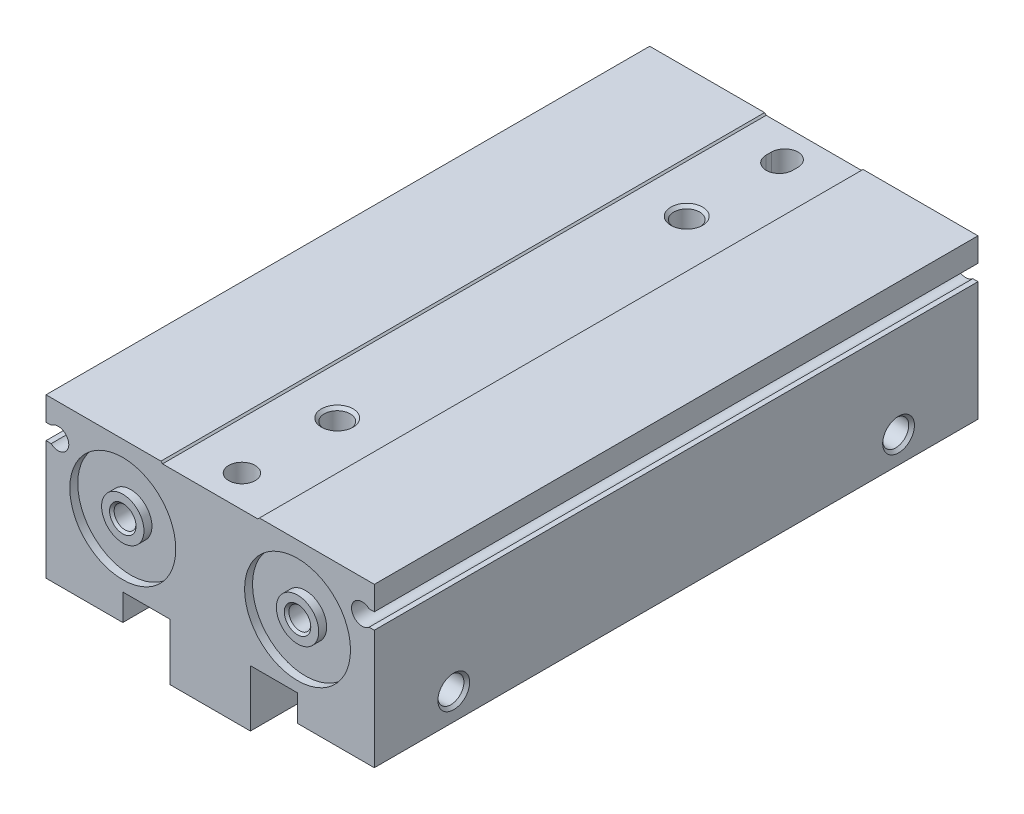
ISO-10303-21;
HEADER;
FILE_DESCRIPTION(('STEP AP214'),'2;1');
FILE_NAME('part.step','',(''),(''),'','','');
FILE_SCHEMA(('AUTOMOTIVE_DESIGN { 1 0 10303 214 1 1 1 1 }'));
ENDSEC;
DATA;
#1=APPLICATION_CONTEXT('core data for automotive mechanical design processes');
#2=APPLICATION_PROTOCOL_DEFINITION('international standard','automotive_design',2000,#1);
#3=PRODUCT_CONTEXT('',#1,'mechanical');
#4=PRODUCT('Part','Part','',(#3));
#5=PRODUCT_RELATED_PRODUCT_CATEGORY('part','',(#4));
#6=PRODUCT_DEFINITION_FORMATION('','',#4);
#7=PRODUCT_DEFINITION_CONTEXT('part definition',#1,'design');
#8=PRODUCT_DEFINITION('design','',#6,#7);
#9=PRODUCT_DEFINITION_SHAPE('','',#8);
#10=(LENGTH_UNIT() NAMED_UNIT(*) SI_UNIT(.MILLI.,.METRE.));
#11=(NAMED_UNIT(*) PLANE_ANGLE_UNIT() SI_UNIT($,.RADIAN.));
#12=(NAMED_UNIT(*) SI_UNIT($,.STERADIAN.) SOLID_ANGLE_UNIT());
#13=UNCERTAINTY_MEASURE_WITH_UNIT(LENGTH_MEASURE(1.E-05),#10,'distance_accuracy_value','');
#14=(GEOMETRIC_REPRESENTATION_CONTEXT(3) GLOBAL_UNCERTAINTY_ASSIGNED_CONTEXT((#13)) GLOBAL_UNIT_ASSIGNED_CONTEXT((#10,
#11,#12)) REPRESENTATION_CONTEXT('',''));
#15=CARTESIAN_POINT('',(0.,0.,0.));
#16=DIRECTION('',(0.,0.,1.));
#17=DIRECTION('',(1.,0.,0.));
#18=AXIS2_PLACEMENT_3D('',#15,#16,#17);
#19=CARTESIAN_POINT('',(7.6,-25.,-15.8));
#20=DIRECTION('',(0.,-1.,0.));
#21=DIRECTION('',(1.,0.,0.));
#22=AXIS2_PLACEMENT_3D('',#19,#20,#21);
#23=PLANE('',#22);
#24=DIRECTION('',(1.,0.,0.));
#25=VECTOR('',#24,1.);
#26=CARTESIAN_POINT('',(7.6,-25.,-15.8));
#27=LINE('',#26,#25);
#28=CARTESIAN_POINT('',(7.6,-25.,-15.8));
#29=VERTEX_POINT('',#28);
#30=CARTESIAN_POINT('',(16.5,-25.,-15.8));
#31=VERTEX_POINT('',#30);
#32=EDGE_CURVE('E251',#29,#31,#27,.T.);
#33=ORIENTED_EDGE('',*,*,#32,.T.);
#34=DIRECTION('',(0.,0.,1.));
#35=VECTOR('',#34,1.);
#36=CARTESIAN_POINT('',(16.5,-25.,-15.8));
#37=LINE('',#36,#35);
#38=CARTESIAN_POINT('',(16.5,-25.,57.));
#39=VERTEX_POINT('',#38);
#40=EDGE_CURVE('E264',#39,#31,#37,.F.);
#41=ORIENTED_EDGE('',*,*,#40,.F.);
#42=DIRECTION('',(-1.,0.,0.));
#43=VECTOR('',#42,1.);
#44=CARTESIAN_POINT('',(16.5,-25.,57.));
#45=LINE('',#44,#43);
#46=CARTESIAN_POINT('',(7.6,-25.,57.));
#47=VERTEX_POINT('',#46);
#48=EDGE_CURVE('E272',#47,#39,#45,.F.);
#49=ORIENTED_EDGE('',*,*,#48,.F.);
#50=DIRECTION('',(0.,0.,-1.));
#51=VECTOR('',#50,1.);
#52=CARTESIAN_POINT('',(7.6,-25.,57.));
#53=LINE('',#52,#51);
#54=EDGE_CURVE('E266',#47,#29,#53,.T.);
#55=ORIENTED_EDGE('',*,*,#54,.T.);
#56=EDGE_LOOP('',(#33,#41,#49,#55));
#57=FACE_BOUND('',#56,.T.);
#58=ADVANCED_FACE('F16',(#57),#23,.T.);
#59=CARTESIAN_POINT('',(7.6,-25.,-57.));
#60=DIRECTION('',(0.,-1.,0.));
#61=DIRECTION('',(1.,0.,0.));
#62=AXIS2_PLACEMENT_3D('',#59,#60,#61);
#63=PLANE('',#62);
#64=DIRECTION('',(-1.,0.,0.));
#65=VECTOR('',#64,1.);
#66=CARTESIAN_POINT('',(16.5,-25.,-36.8));
#67=LINE('',#66,#65);
#68=CARTESIAN_POINT('',(16.5,-25.,-36.8));
#69=VERTEX_POINT('',#68);
#70=CARTESIAN_POINT('',(7.6,-25.,-36.8));
#71=VERTEX_POINT('',#70);
#72=EDGE_CURVE('E283',#69,#71,#67,.T.);
#73=ORIENTED_EDGE('',*,*,#72,.T.);
#74=DIRECTION('',(0.,0.,-1.));
#75=VECTOR('',#74,1.);
#76=CARTESIAN_POINT('',(7.6,-25.,-36.8));
#77=LINE('',#76,#75);
#78=CARTESIAN_POINT('',(7.6,-25.,-57.));
#79=VERTEX_POINT('',#78);
#80=EDGE_CURVE('E288',#71,#79,#77,.T.);
#81=ORIENTED_EDGE('',*,*,#80,.T.);
#82=DIRECTION('',(1.,0.,0.));
#83=VECTOR('',#82,1.);
#84=CARTESIAN_POINT('',(7.6,-25.,-57.));
#85=LINE('',#84,#83);
#86=CARTESIAN_POINT('',(16.5,-25.,-57.));
#87=VERTEX_POINT('',#86);
#88=EDGE_CURVE('E293',#79,#87,#85,.T.);
#89=ORIENTED_EDGE('',*,*,#88,.T.);
#90=DIRECTION('',(0.,0.,1.));
#91=VECTOR('',#90,1.);
#92=CARTESIAN_POINT('',(16.5,-25.,-57.));
#93=LINE('',#92,#91);
#94=EDGE_CURVE('E298',#69,#87,#93,.F.);
#95=ORIENTED_EDGE('',*,*,#94,.F.);
#96=EDGE_LOOP('',(#73,#81,#89,#95));
#97=FACE_BOUND('',#96,.T.);
#98=ADVANCED_FACE('F948',(#97),#63,.T.);
#99=CARTESIAN_POINT('',(-16.5,-25.,36.8));
#100=DIRECTION('',(0.,-1.,0.));
#101=DIRECTION('',(1.,0.,0.));
#102=AXIS2_PLACEMENT_3D('',#99,#100,#101);
#103=PLANE('',#102);
#104=DIRECTION('',(1.,0.,0.));
#105=VECTOR('',#104,1.);
#106=CARTESIAN_POINT('',(-16.5,-25.,36.8));
#107=LINE('',#106,#105);
#108=CARTESIAN_POINT('',(-16.5,-25.,36.8));
#109=VERTEX_POINT('',#108);
#110=CARTESIAN_POINT('',(-7.6,-25.,36.8));
#111=VERTEX_POINT('',#110);
#112=EDGE_CURVE('E303',#109,#111,#107,.T.);
#113=ORIENTED_EDGE('',*,*,#112,.T.);
#114=DIRECTION('',(0.,0.,1.));
#115=VECTOR('',#114,1.);
#116=CARTESIAN_POINT('',(-7.6,-25.,36.8));
#117=LINE('',#116,#115);
#118=CARTESIAN_POINT('',(-7.6,-25.,57.));
#119=VERTEX_POINT('',#118);
#120=EDGE_CURVE('E308',#119,#111,#117,.F.);
#121=ORIENTED_EDGE('',*,*,#120,.F.);
#122=DIRECTION('',(-1.,0.,0.));
#123=VECTOR('',#122,1.);
#124=CARTESIAN_POINT('',(-7.6,-25.,57.));
#125=LINE('',#124,#123);
#126=CARTESIAN_POINT('',(-16.5,-25.,57.));
#127=VERTEX_POINT('',#126);
#128=EDGE_CURVE('E313',#127,#119,#125,.F.);
#129=ORIENTED_EDGE('',*,*,#128,.F.);
#130=DIRECTION('',(0.,0.,-1.));
#131=VECTOR('',#130,1.);
#132=CARTESIAN_POINT('',(-16.5,-25.,57.));
#133=LINE('',#132,#131);
#134=EDGE_CURVE('E317',#127,#109,#133,.T.);
#135=ORIENTED_EDGE('',*,*,#134,.T.);
#136=EDGE_LOOP('',(#113,#121,#129,#135));
#137=FACE_BOUND('',#136,.T.);
#138=ADVANCED_FACE('F953',(#137),#103,.T.);
#139=CARTESIAN_POINT('',(-16.5,-25.,-57.));
#140=DIRECTION('',(0.,-1.,0.));
#141=DIRECTION('',(1.,0.,0.));
#142=AXIS2_PLACEMENT_3D('',#139,#140,#141);
#143=PLANE('',#142);
#144=DIRECTION('',(-1.,0.,0.));
#145=VECTOR('',#144,1.);
#146=CARTESIAN_POINT('',(-7.6,-25.,15.8));
#147=LINE('',#146,#145);
#148=CARTESIAN_POINT('',(-7.6,-25.,15.8));
#149=VERTEX_POINT('',#148);
#150=CARTESIAN_POINT('',(-16.5,-25.,15.8));
#151=VERTEX_POINT('',#150);
#152=EDGE_CURVE('E322',#149,#151,#147,.T.);
#153=ORIENTED_EDGE('',*,*,#152,.T.);
#154=DIRECTION('',(0.,0.,-1.));
#155=VECTOR('',#154,1.);
#156=CARTESIAN_POINT('',(-16.5,-25.,15.8));
#157=LINE('',#156,#155);
#158=CARTESIAN_POINT('',(-16.5,-25.,-57.));
#159=VERTEX_POINT('',#158);
#160=EDGE_CURVE('E327',#151,#159,#157,.T.);
#161=ORIENTED_EDGE('',*,*,#160,.T.);
#162=DIRECTION('',(1.,0.,0.));
#163=VECTOR('',#162,1.);
#164=CARTESIAN_POINT('',(-16.5,-25.,-57.));
#165=LINE('',#164,#163);
#166=CARTESIAN_POINT('',(-7.6,-25.,-57.));
#167=VERTEX_POINT('',#166);
#168=EDGE_CURVE('E332',#159,#167,#165,.T.);
#169=ORIENTED_EDGE('',*,*,#168,.T.);
#170=DIRECTION('',(0.,0.,1.));
#171=VECTOR('',#170,1.);
#172=CARTESIAN_POINT('',(-7.6,-25.,-57.));
#173=LINE('',#172,#171);
#174=EDGE_CURVE('E337',#149,#167,#173,.F.);
#175=ORIENTED_EDGE('',*,*,#174,.F.);
#176=EDGE_LOOP('',(#153,#161,#169,#175));
#177=FACE_BOUND('',#176,.T.);
#178=ADVANCED_FACE('F959',(#177),#143,.T.);
#179=CARTESIAN_POINT('',(-31.,-7.5,57.));
#180=DIRECTION('',(0.,1.,0.));
#181=DIRECTION('',(1.,0.,0.));
#182=AXIS2_PLACEMENT_3D('',#179,#180,#181);
#183=PLANE('',#182);
#184=DIRECTION('',(-1.,0.,0.));
#185=VECTOR('',#184,1.);
#186=CARTESIAN_POINT('',(-30.022875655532,-7.5,-57.));
#187=LINE('',#186,#185);
#188=CARTESIAN_POINT('',(-30.022875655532,-7.5,-57.));
#189=VERTEX_POINT('',#188);
#190=CARTESIAN_POINT('',(-31.,-7.5,-57.));
#191=VERTEX_POINT('',#190);
#192=EDGE_CURVE('E342',#189,#191,#187,.T.);
#193=ORIENTED_EDGE('',*,*,#192,.T.);
#194=DIRECTION('',(0.,0.,1.));
#195=VECTOR('',#194,1.);
#196=CARTESIAN_POINT('',(-31.,-7.5,-57.));
#197=LINE('',#196,#195);
#198=CARTESIAN_POINT('',(-31.,-7.5,57.));
#199=VERTEX_POINT('',#198);
#200=EDGE_CURVE('E347',#199,#191,#197,.F.);
#201=ORIENTED_EDGE('',*,*,#200,.F.);
#202=DIRECTION('',(1.,0.,0.));
#203=VECTOR('',#202,1.);
#204=CARTESIAN_POINT('',(-31.,-7.5,57.));
#205=LINE('',#204,#203);
#206=CARTESIAN_POINT('',(-30.022875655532,-7.5,57.));
#207=VERTEX_POINT('',#206);
#208=EDGE_CURVE('E352',#207,#199,#205,.F.);
#209=ORIENTED_EDGE('',*,*,#208,.F.);
#210=DIRECTION('',(0.,0.,-1.));
#211=VECTOR('',#210,1.);
#212=CARTESIAN_POINT('',(-30.022875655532,-7.5,57.));
#213=LINE('',#212,#211);
#214=EDGE_CURVE('E356',#207,#189,#213,.T.);
#215=ORIENTED_EDGE('',*,*,#214,.T.);
#216=EDGE_LOOP('',(#193,#201,#209,#215));
#217=FACE_BOUND('',#216,.T.);
#218=ADVANCED_FACE('F963',(#217),#183,.T.);
#219=CARTESIAN_POINT('',(-31.,-30.,57.));
#220=DIRECTION('',(-1.,0.,0.));
#221=DIRECTION('',(0.,1.,0.));
#222=AXIS2_PLACEMENT_3D('',#219,#220,#221);
#223=PLANE('',#222);
#224=DIRECTION('',(0.,-1.,0.));
#225=VECTOR('',#224,1.);
#226=CARTESIAN_POINT('',(-31.,-7.5,-57.));
#227=LINE('',#226,#225);
#228=CARTESIAN_POINT('',(-31.,-30.,-57.));
#229=VERTEX_POINT('',#228);
#230=EDGE_CURVE('E361',#191,#229,#227,.T.);
#231=ORIENTED_EDGE('',*,*,#230,.T.);
#232=DIRECTION('',(0.,0.,1.));
#233=VECTOR('',#232,1.);
#234=CARTESIAN_POINT('',(-31.,-30.,-57.));
#235=LINE('',#234,#233);
#236=CARTESIAN_POINT('',(-31.,-30.,57.));
#237=VERTEX_POINT('',#236);
#238=EDGE_CURVE('E366',#237,#229,#235,.F.);
#239=ORIENTED_EDGE('',*,*,#238,.F.);
#240=DIRECTION('',(0.,1.,0.));
#241=VECTOR('',#240,1.);
#242=CARTESIAN_POINT('',(-31.,-30.,57.));
#243=LINE('',#242,#241);
#244=EDGE_CURVE('E371',#199,#237,#243,.F.);
#245=ORIENTED_EDGE('',*,*,#244,.F.);
#246=ORIENTED_EDGE('',*,*,#200,.T.);
#247=EDGE_LOOP('',(#231,#239,#245,#246));
#248=FACE_BOUND('',#247,.T.);
#249=CARTESIAN_POINT('',(-31.,-25.,-42.));
#250=DIRECTION('',(1.,0.,0.));
#251=DIRECTION('',(0.,0.,1.));
#252=AXIS2_PLACEMENT_3D('',#249,#250,#251);
#253=CIRCLE('',#252,3.);
#254=CARTESIAN_POINT('',(-31.,-25.,-39.));
#255=VERTEX_POINT('',#254);
#256=EDGE_CURVE('E375',#255,#255,#253,.F.);
#257=ORIENTED_EDGE('',*,*,#256,.F.);
#258=EDGE_LOOP('',(#257));
#259=FACE_BOUND('',#258,.T.);
#260=CARTESIAN_POINT('',(-31.,-25.,42.));
#261=DIRECTION('',(1.,0.,0.));
#262=DIRECTION('',(0.,0.,1.));
#263=AXIS2_PLACEMENT_3D('',#260,#261,#262);
#264=CIRCLE('',#263,3.);
#265=CARTESIAN_POINT('',(-31.,-25.,45.));
#266=VERTEX_POINT('',#265);
#267=EDGE_CURVE('E380',#266,#266,#264,.F.);
#268=ORIENTED_EDGE('',*,*,#267,.F.);
#269=EDGE_LOOP('',(#268));
#270=FACE_BOUND('',#269,.T.);
#271=ADVANCED_FACE('F967',(#248,#259,#270),#223,.T.);
#272=CARTESIAN_POINT('',(-31.,-30.,-57.));
#273=DIRECTION('',(0.,-1.,0.));
#274=DIRECTION('',(1.,0.,0.));
#275=AXIS2_PLACEMENT_3D('',#272,#273,#274);
#276=PLANE('',#275);
#277=DIRECTION('',(1.,0.,0.));
#278=VECTOR('',#277,1.);
#279=CARTESIAN_POINT('',(-31.,-30.,-57.));
#280=LINE('',#279,#278);
#281=CARTESIAN_POINT('',(-16.5,-30.,-57.));
#282=VERTEX_POINT('',#281);
#283=EDGE_CURVE('E383',#229,#282,#280,.T.);
#284=ORIENTED_EDGE('',*,*,#283,.T.);
#285=DIRECTION('',(0.,0.,1.));
#286=VECTOR('',#285,1.);
#287=CARTESIAN_POINT('',(-16.5,-30.,-57.));
#288=LINE('',#287,#286);
#289=CARTESIAN_POINT('',(-16.5,-30.,57.));
#290=VERTEX_POINT('',#289);
#291=EDGE_CURVE('E386',#290,#282,#288,.F.);
#292=ORIENTED_EDGE('',*,*,#291,.F.);
#293=DIRECTION('',(-1.,0.,0.));
#294=VECTOR('',#293,1.);
#295=CARTESIAN_POINT('',(-16.5,-30.,57.));
#296=LINE('',#295,#294);
#297=EDGE_CURVE('E391',#237,#290,#296,.F.);
#298=ORIENTED_EDGE('',*,*,#297,.F.);
#299=ORIENTED_EDGE('',*,*,#238,.T.);
#300=EDGE_LOOP('',(#284,#292,#298,#299));
#301=FACE_BOUND('',#300,.T.);
#302=CARTESIAN_POINT('',(-26.,-30.,34.));
#303=DIRECTION('',(0.,1.,0.));
#304=DIRECTION('',(0.,0.,-1.));
#305=AXIS2_PLACEMENT_3D('',#302,#303,#304);
#306=CIRCLE('',#305,3.);
#307=CARTESIAN_POINT('',(-26.,-30.,31.));
#308=VERTEX_POINT('',#307);
#309=EDGE_CURVE('E395',#308,#308,#306,.T.);
#310=ORIENTED_EDGE('',*,*,#309,.T.);
#311=EDGE_LOOP('',(#310));
#312=FACE_BOUND('',#311,.T.);
#313=CARTESIAN_POINT('',(-26.,-30.,-34.));
#314=DIRECTION('',(0.,1.,0.));
#315=DIRECTION('',(-1.4205372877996E-07,0.,-0.99999999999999));
#316=AXIS2_PLACEMENT_3D('',#313,#314,#315);
#317=CIRCLE('',#316,3.);
#318=CARTESIAN_POINT('',(-26.0000004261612,-30.,-37.));
#319=VERTEX_POINT('',#318);
#320=EDGE_CURVE('E400',#319,#319,#317,.T.);
#321=ORIENTED_EDGE('',*,*,#320,.T.);
#322=EDGE_LOOP('',(#321));
#323=FACE_BOUND('',#322,.T.);
#324=ADVANCED_FACE('F971',(#301,#312,#323),#276,.T.);
#325=CARTESIAN_POINT('',(-16.5,-30.,-57.));
#326=DIRECTION('',(1.,0.,0.));
#327=DIRECTION('',(0.,1.,0.));
#328=AXIS2_PLACEMENT_3D('',#325,#326,#327);
#329=PLANE('',#328);
#330=DIRECTION('',(0.,1.,0.));
#331=VECTOR('',#330,1.);
#332=CARTESIAN_POINT('',(-16.5,-30.,-57.));
#333=LINE('',#332,#331);
#334=EDGE_CURVE('E403',#282,#159,#333,.T.);
#335=ORIENTED_EDGE('',*,*,#334,.T.);
#336=ORIENTED_EDGE('',*,*,#160,.F.);
#337=DIRECTION('',(0.,1.,0.));
#338=VECTOR('',#337,1.);
#339=CARTESIAN_POINT('',(-16.5,-25.,15.8));
#340=LINE('',#339,#338);
#341=CARTESIAN_POINT('',(-16.5,-23.4,15.8));
#342=VERTEX_POINT('',#341);
#343=EDGE_CURVE('E406',#342,#151,#340,.F.);
#344=ORIENTED_EDGE('',*,*,#343,.F.);
#345=DIRECTION('',(0.,0.,1.));
#346=VECTOR('',#345,1.);
#347=CARTESIAN_POINT('',(-16.5,-23.4,15.8));
#348=LINE('',#347,#346);
#349=CARTESIAN_POINT('',(-16.5,-23.4,36.8));
#350=VERTEX_POINT('',#349);
#351=EDGE_CURVE('E410',#342,#350,#348,.T.);
#352=ORIENTED_EDGE('',*,*,#351,.T.);
#353=DIRECTION('',(0.,-1.,0.));
#354=VECTOR('',#353,1.);
#355=CARTESIAN_POINT('',(-16.5,-23.4,36.8));
#356=LINE('',#355,#354);
#357=EDGE_CURVE('E415',#350,#109,#356,.T.);
#358=ORIENTED_EDGE('',*,*,#357,.T.);
#359=ORIENTED_EDGE('',*,*,#134,.F.);
#360=DIRECTION('',(0.,-1.,0.));
#361=VECTOR('',#360,1.);
#362=CARTESIAN_POINT('',(-16.5,-25.,57.));
#363=LINE('',#362,#361);
#364=EDGE_CURVE('E420',#290,#127,#363,.F.);
#365=ORIENTED_EDGE('',*,*,#364,.F.);
#366=ORIENTED_EDGE('',*,*,#291,.T.);
#367=EDGE_LOOP('',(#335,#336,#344,#352,#358,#359,#365,#366));
#368=FACE_BOUND('',#367,.T.);
#369=ADVANCED_FACE('F975',(#368),#329,.T.);
#370=CARTESIAN_POINT('',(-7.6,-35.7,57.));
#371=DIRECTION('',(-1.,0.,0.));
#372=DIRECTION('',(0.,1.,0.));
#373=AXIS2_PLACEMENT_3D('',#370,#371,#372);
#374=PLANE('',#373);
#375=DIRECTION('',(0.,-1.,0.));
#376=VECTOR('',#375,1.);
#377=CARTESIAN_POINT('',(-7.6,-25.,-57.));
#378=LINE('',#377,#376);
#379=CARTESIAN_POINT('',(-7.6,-35.7,-57.));
#380=VERTEX_POINT('',#379);
#381=EDGE_CURVE('E424',#167,#380,#378,.T.);
#382=ORIENTED_EDGE('',*,*,#381,.T.);
#383=DIRECTION('',(0.,0.,1.));
#384=VECTOR('',#383,1.);
#385=CARTESIAN_POINT('',(-7.6,-35.7,-57.));
#386=LINE('',#385,#384);
#387=CARTESIAN_POINT('',(-7.6,-35.7,57.));
#388=VERTEX_POINT('',#387);
#389=EDGE_CURVE('E429',#388,#380,#386,.F.);
#390=ORIENTED_EDGE('',*,*,#389,.F.);
#391=DIRECTION('',(0.,1.,0.));
#392=VECTOR('',#391,1.);
#393=CARTESIAN_POINT('',(-7.6,-35.7,57.));
#394=LINE('',#393,#392);
#395=EDGE_CURVE('E434',#119,#388,#394,.F.);
#396=ORIENTED_EDGE('',*,*,#395,.F.);
#397=ORIENTED_EDGE('',*,*,#120,.T.);
#398=DIRECTION('',(0.,1.,0.));
#399=VECTOR('',#398,1.);
#400=CARTESIAN_POINT('',(-7.6,-25.,36.8));
#401=LINE('',#400,#399);
#402=CARTESIAN_POINT('',(-7.6,-23.4,36.8));
#403=VERTEX_POINT('',#402);
#404=EDGE_CURVE('E438',#403,#111,#401,.F.);
#405=ORIENTED_EDGE('',*,*,#404,.F.);
#406=DIRECTION('',(0.,0.,-1.));
#407=VECTOR('',#406,1.);
#408=CARTESIAN_POINT('',(-7.6,-23.4,36.8));
#409=LINE('',#408,#407);
#410=CARTESIAN_POINT('',(-7.6,-23.4,15.8));
#411=VERTEX_POINT('',#410);
#412=EDGE_CURVE('E442',#403,#411,#409,.T.);
#413=ORIENTED_EDGE('',*,*,#412,.T.);
#414=DIRECTION('',(0.,-1.,0.));
#415=VECTOR('',#414,1.);
#416=CARTESIAN_POINT('',(-7.6,-23.4,15.8));
#417=LINE('',#416,#415);
#418=EDGE_CURVE('E447',#411,#149,#417,.T.);
#419=ORIENTED_EDGE('',*,*,#418,.T.);
#420=ORIENTED_EDGE('',*,*,#174,.T.);
#421=EDGE_LOOP('',(#382,#390,#396,#397,#405,#413,#419,#420));
#422=FACE_BOUND('',#421,.T.);
#423=ADVANCED_FACE('F979',(#422),#374,.T.);
#424=CARTESIAN_POINT('',(-7.6,-35.7,-57.));
#425=DIRECTION('',(0.,-1.,0.));
#426=DIRECTION('',(1.,0.,0.));
#427=AXIS2_PLACEMENT_3D('',#424,#425,#426);
#428=PLANE('',#427);
#429=DIRECTION('',(1.,0.,0.));
#430=VECTOR('',#429,1.);
#431=CARTESIAN_POINT('',(-7.6,-35.7,-57.));
#432=LINE('',#431,#430);
#433=CARTESIAN_POINT('',(7.6,-35.7,-57.));
#434=VERTEX_POINT('',#433);
#435=EDGE_CURVE('E452',#380,#434,#432,.T.);
#436=ORIENTED_EDGE('',*,*,#435,.T.);
#437=DIRECTION('',(0.,0.,1.));
#438=VECTOR('',#437,1.);
#439=CARTESIAN_POINT('',(7.6,-35.7,-57.));
#440=LINE('',#439,#438);
#441=CARTESIAN_POINT('',(7.6,-35.7,57.));
#442=VERTEX_POINT('',#441);
#443=EDGE_CURVE('E457',#442,#434,#440,.F.);
#444=ORIENTED_EDGE('',*,*,#443,.F.);
#445=DIRECTION('',(-1.,0.,0.));
#446=VECTOR('',#445,1.);
#447=CARTESIAN_POINT('',(7.6,-35.7,57.));
#448=LINE('',#447,#446);
#449=EDGE_CURVE('E462',#388,#442,#448,.F.);
#450=ORIENTED_EDGE('',*,*,#449,.F.);
#451=ORIENTED_EDGE('',*,*,#389,.T.);
#452=EDGE_LOOP('',(#436,#444,#450,#451));
#453=FACE_BOUND('',#452,.T.);
#454=CARTESIAN_POINT('',(0.,-35.7,-33.));
#455=DIRECTION('',(0.,1.,0.));
#456=DIRECTION('',(0.,0.,-1.));
#457=AXIS2_PLACEMENT_3D('',#454,#455,#456);
#458=CIRCLE('',#457,5.);
#459=CARTESIAN_POINT('',(0.,-35.7,-38.));
#460=VERTEX_POINT('',#459);
#461=EDGE_CURVE('E466',#460,#460,#458,.F.);
#462=ORIENTED_EDGE('',*,*,#461,.F.);
#463=EDGE_LOOP('',(#462));
#464=FACE_BOUND('',#463,.T.);
#465=CARTESIAN_POINT('',(0.,-35.7,33.));
#466=DIRECTION('',(0.,1.,0.));
#467=DIRECTION('',(0.,0.,-1.));
#468=AXIS2_PLACEMENT_3D('',#465,#466,#467);
#469=CIRCLE('',#468,5.);
#470=CARTESIAN_POINT('',(0.,-35.7,28.));
#471=VERTEX_POINT('',#470);
#472=EDGE_CURVE('E471',#471,#471,#469,.F.);
#473=ORIENTED_EDGE('',*,*,#472,.F.);
#474=EDGE_LOOP('',(#473));
#475=FACE_BOUND('',#474,.T.);
#476=ADVANCED_FACE('F983',(#453,#464,#475),#428,.T.);
#477=CARTESIAN_POINT('',(7.6,-35.7,-57.));
#478=DIRECTION('',(1.,0.,0.));
#479=DIRECTION('',(0.,1.,0.));
#480=AXIS2_PLACEMENT_3D('',#477,#478,#479);
#481=PLANE('',#480);
#482=DIRECTION('',(0.,1.,0.));
#483=VECTOR('',#482,1.);
#484=CARTESIAN_POINT('',(7.6,-35.7,-57.));
#485=LINE('',#484,#483);
#486=EDGE_CURVE('E474',#434,#79,#485,.T.);
#487=ORIENTED_EDGE('',*,*,#486,.T.);
#488=ORIENTED_EDGE('',*,*,#80,.F.);
#489=DIRECTION('',(0.,1.,0.));
#490=VECTOR('',#489,1.);
#491=CARTESIAN_POINT('',(7.6,-25.,-36.8));
#492=LINE('',#491,#490);
#493=CARTESIAN_POINT('',(7.6,-23.4,-36.8));
#494=VERTEX_POINT('',#493);
#495=EDGE_CURVE('E477',#494,#71,#492,.F.);
#496=ORIENTED_EDGE('',*,*,#495,.F.);
#497=DIRECTION('',(0.,0.,1.));
#498=VECTOR('',#497,1.);
#499=CARTESIAN_POINT('',(7.6,-23.4,-36.8));
#500=LINE('',#499,#498);
#501=CARTESIAN_POINT('',(7.6,-23.4,-15.8));
#502=VERTEX_POINT('',#501);
#503=EDGE_CURVE('E481',#494,#502,#500,.T.);
#504=ORIENTED_EDGE('',*,*,#503,.T.);
#505=DIRECTION('',(0.,-1.,0.));
#506=VECTOR('',#505,1.);
#507=CARTESIAN_POINT('',(7.6,-23.4,-15.8));
#508=LINE('',#507,#506);
#509=EDGE_CURVE('E486',#502,#29,#508,.T.);
#510=ORIENTED_EDGE('',*,*,#509,.T.);
#511=ORIENTED_EDGE('',*,*,#54,.F.);
#512=DIRECTION('',(0.,-1.,0.));
#513=VECTOR('',#512,1.);
#514=CARTESIAN_POINT('',(7.6,-25.,57.));
#515=LINE('',#514,#513);
#516=EDGE_CURVE('E490',#442,#47,#515,.F.);
#517=ORIENTED_EDGE('',*,*,#516,.F.);
#518=ORIENTED_EDGE('',*,*,#443,.T.);
#519=EDGE_LOOP('',(#487,#488,#496,#504,#510,#511,#517,#518));
#520=FACE_BOUND('',#519,.T.);
#521=ADVANCED_FACE('F987',(#520),#481,.T.);
#522=CARTESIAN_POINT('',(16.5,-30.,57.));
#523=DIRECTION('',(-1.,0.,0.));
#524=DIRECTION('',(0.,1.,0.));
#525=AXIS2_PLACEMENT_3D('',#522,#523,#524);
#526=PLANE('',#525);
#527=DIRECTION('',(0.,-1.,0.));
#528=VECTOR('',#527,1.);
#529=CARTESIAN_POINT('',(16.5,-25.,-57.));
#530=LINE('',#529,#528);
#531=CARTESIAN_POINT('',(16.5,-30.,-57.));
#532=VERTEX_POINT('',#531);
#533=EDGE_CURVE('E494',#87,#532,#530,.T.);
#534=ORIENTED_EDGE('',*,*,#533,.T.);
#535=DIRECTION('',(0.,0.,1.));
#536=VECTOR('',#535,1.);
#537=CARTESIAN_POINT('',(16.5,-30.,-57.));
#538=LINE('',#537,#536);
#539=CARTESIAN_POINT('',(16.5,-30.,57.));
#540=VERTEX_POINT('',#539);
#541=EDGE_CURVE('E498',#540,#532,#538,.F.);
#542=ORIENTED_EDGE('',*,*,#541,.F.);
#543=DIRECTION('',(0.,1.,0.));
#544=VECTOR('',#543,1.);
#545=CARTESIAN_POINT('',(16.5,-30.,57.));
#546=LINE('',#545,#544);
#547=EDGE_CURVE('E258',#39,#540,#546,.F.);
#548=ORIENTED_EDGE('',*,*,#547,.F.);
#549=ORIENTED_EDGE('',*,*,#40,.T.);
#550=DIRECTION('',(0.,1.,0.));
#551=VECTOR('',#550,1.);
#552=CARTESIAN_POINT('',(16.5,-25.,-15.8));
#553=LINE('',#552,#551);
#554=CARTESIAN_POINT('',(16.5,-23.4,-15.8));
#555=VERTEX_POINT('',#554);
#556=EDGE_CURVE('E247',#555,#31,#553,.F.);
#557=ORIENTED_EDGE('',*,*,#556,.F.);
#558=DIRECTION('',(0.,0.,-1.));
#559=VECTOR('',#558,1.);
#560=CARTESIAN_POINT('',(16.5,-23.4,-15.8));
#561=LINE('',#560,#559);
#562=CARTESIAN_POINT('',(16.5,-23.4,-36.8));
#563=VERTEX_POINT('',#562);
#564=EDGE_CURVE('E257',#555,#563,#561,.T.);
#565=ORIENTED_EDGE('',*,*,#564,.T.);
#566=DIRECTION('',(0.,-1.,0.));
#567=VECTOR('',#566,1.);
#568=CARTESIAN_POINT('',(16.5,-23.4,-36.8));
#569=LINE('',#568,#567);
#570=EDGE_CURVE('E511',#563,#69,#569,.T.);
#571=ORIENTED_EDGE('',*,*,#570,.T.);
#572=ORIENTED_EDGE('',*,*,#94,.T.);
#573=EDGE_LOOP('',(#534,#542,#548,#549,#557,#565,#571,#572));
#574=FACE_BOUND('',#573,.T.);
#575=ADVANCED_FACE('F270',(#574),#526,.T.);
#576=CARTESIAN_POINT('',(16.5,-30.,-57.));
#577=DIRECTION('',(0.,-1.,0.));
#578=DIRECTION('',(1.,0.,0.));
#579=AXIS2_PLACEMENT_3D('',#576,#577,#578);
#580=PLANE('',#579);
#581=DIRECTION('',(1.,0.,0.));
#582=VECTOR('',#581,1.);
#583=CARTESIAN_POINT('',(16.5,-30.,-57.));
#584=LINE('',#583,#582);
#585=CARTESIAN_POINT('',(31.,-30.,-57.));
#586=VERTEX_POINT('',#585);
#587=EDGE_CURVE('E516',#532,#586,#584,.T.);
#588=ORIENTED_EDGE('',*,*,#587,.T.);
#589=DIRECTION('',(0.,0.,1.));
#590=VECTOR('',#589,1.);
#591=CARTESIAN_POINT('',(31.,-30.,-57.));
#592=LINE('',#591,#590);
#593=CARTESIAN_POINT('',(31.,-30.,57.));
#594=VERTEX_POINT('',#593);
#595=EDGE_CURVE('E521',#594,#586,#592,.F.);
#596=ORIENTED_EDGE('',*,*,#595,.F.);
#597=DIRECTION('',(-1.,0.,0.));
#598=VECTOR('',#597,1.);
#599=CARTESIAN_POINT('',(31.,-30.,57.));
#600=LINE('',#599,#598);
#601=EDGE_CURVE('E526',#540,#594,#600,.F.);
#602=ORIENTED_EDGE('',*,*,#601,.F.);
#603=ORIENTED_EDGE('',*,*,#541,.T.);
#604=EDGE_LOOP('',(#588,#596,#602,#603));
#605=FACE_BOUND('',#604,.T.);
#606=CARTESIAN_POINT('',(26.,-30.,-34.));
#607=DIRECTION('',(0.,1.,0.));
#608=DIRECTION('',(-1.42053988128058E-07,0.,-0.99999999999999));
#609=AXIS2_PLACEMENT_3D('',#606,#607,#608);
#610=CIRCLE('',#609,3.);
#611=CARTESIAN_POINT('',(25.999999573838,-30.,-37.));
#612=VERTEX_POINT('',#611);
#613=EDGE_CURVE('E530',#612,#612,#610,.T.);
#614=ORIENTED_EDGE('',*,*,#613,.T.);
#615=EDGE_LOOP('',(#614));
#616=FACE_BOUND('',#615,.T.);
#617=CARTESIAN_POINT('',(26.,-30.,34.));
#618=DIRECTION('',(0.,1.,0.));
#619=DIRECTION('',(0.,0.,-1.));
#620=AXIS2_PLACEMENT_3D('',#617,#618,#619);
#621=CIRCLE('',#620,3.);
#622=CARTESIAN_POINT('',(26.,-30.,31.));
#623=VERTEX_POINT('',#622);
#624=EDGE_CURVE('E535',#623,#623,#621,.T.);
#625=ORIENTED_EDGE('',*,*,#624,.T.);
#626=EDGE_LOOP('',(#625));
#627=FACE_BOUND('',#626,.T.);
#628=ADVANCED_FACE('F994',(#605,#616,#627),#580,.T.);
#629=CARTESIAN_POINT('',(31.,-30.,-57.));
#630=DIRECTION('',(1.,0.,0.));
#631=DIRECTION('',(0.,1.,0.));
#632=AXIS2_PLACEMENT_3D('',#629,#630,#631);
#633=PLANE('',#632);
#634=DIRECTION('',(0.,1.,0.));
#635=VECTOR('',#634,1.);
#636=CARTESIAN_POINT('',(31.,-30.,-57.));
#637=LINE('',#636,#635);
#638=CARTESIAN_POINT('',(31.,-7.5,-57.));
#639=VERTEX_POINT('',#638);
#640=EDGE_CURVE('E538',#586,#639,#637,.T.);
#641=ORIENTED_EDGE('',*,*,#640,.T.);
#642=DIRECTION('',(0.,0.,1.));
#643=VECTOR('',#642,1.);
#644=CARTESIAN_POINT('',(31.,-7.5,-57.));
#645=LINE('',#644,#643);
#646=CARTESIAN_POINT('',(31.,-7.5,57.));
#647=VERTEX_POINT('',#646);
#648=EDGE_CURVE('E541',#647,#639,#645,.F.);
#649=ORIENTED_EDGE('',*,*,#648,.F.);
#650=DIRECTION('',(0.,-1.,0.));
#651=VECTOR('',#650,1.);
#652=CARTESIAN_POINT('',(31.,-7.5,57.));
#653=LINE('',#652,#651);
#654=EDGE_CURVE('E546',#594,#647,#653,.F.);
#655=ORIENTED_EDGE('',*,*,#654,.F.);
#656=ORIENTED_EDGE('',*,*,#595,.T.);
#657=EDGE_LOOP('',(#641,#649,#655,#656));
#658=FACE_BOUND('',#657,.T.);
#659=CARTESIAN_POINT('',(31.,-25.,-42.));
#660=DIRECTION('',(-1.,0.,0.));
#661=DIRECTION('',(0.,-1.4205372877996E-07,-0.99999999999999));
#662=AXIS2_PLACEMENT_3D('',#659,#660,#661);
#663=CIRCLE('',#662,3.);
#664=CARTESIAN_POINT('',(31.,-25.0000004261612,-45.));
#665=VERTEX_POINT('',#664);
#666=EDGE_CURVE('E550',#665,#665,#663,.T.);
#667=ORIENTED_EDGE('',*,*,#666,.T.);
#668=EDGE_LOOP('',(#667));
#669=FACE_BOUND('',#668,.T.);
#670=CARTESIAN_POINT('',(31.,-25.,42.));
#671=DIRECTION('',(-1.,0.,0.));
#672=DIRECTION('',(0.,0.,-1.));
#673=AXIS2_PLACEMENT_3D('',#670,#671,#672);
#674=CIRCLE('',#673,3.);
#675=CARTESIAN_POINT('',(31.,-25.,39.));
#676=VERTEX_POINT('',#675);
#677=EDGE_CURVE('E555',#676,#676,#674,.T.);
#678=ORIENTED_EDGE('',*,*,#677,.T.);
#679=EDGE_LOOP('',(#678));
#680=FACE_BOUND('',#679,.T.);
#681=ADVANCED_FACE('F997',(#658,#669,#680),#633,.T.);
#682=CARTESIAN_POINT('',(30.022875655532,-7.5,57.));
#683=DIRECTION('',(0.,1.,0.));
#684=DIRECTION('',(1.,0.,0.));
#685=AXIS2_PLACEMENT_3D('',#682,#683,#684);
#686=PLANE('',#685);
#687=DIRECTION('',(-1.,0.,0.));
#688=VECTOR('',#687,1.);
#689=CARTESIAN_POINT('',(31.,-7.5,-57.));
#690=LINE('',#689,#688);
#691=CARTESIAN_POINT('',(30.022875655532,-7.5,-57.));
#692=VERTEX_POINT('',#691);
#693=EDGE_CURVE('E558',#639,#692,#690,.T.);
#694=ORIENTED_EDGE('',*,*,#693,.T.);
#695=DIRECTION('',(0.,0.,1.));
#696=VECTOR('',#695,1.);
#697=CARTESIAN_POINT('',(30.022875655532,-7.5,-57.));
#698=LINE('',#697,#696);
#699=CARTESIAN_POINT('',(30.022875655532,-7.5,57.));
#700=VERTEX_POINT('',#699);
#701=EDGE_CURVE('E561',#700,#692,#698,.F.);
#702=ORIENTED_EDGE('',*,*,#701,.F.);
#703=DIRECTION('',(1.,0.,0.));
#704=VECTOR('',#703,1.);
#705=CARTESIAN_POINT('',(30.022875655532,-7.5,57.));
#706=LINE('',#705,#704);
#707=EDGE_CURVE('E566',#647,#700,#706,.F.);
#708=ORIENTED_EDGE('',*,*,#707,.F.);
#709=ORIENTED_EDGE('',*,*,#648,.T.);
#710=EDGE_LOOP('',(#694,#702,#708,#709));
#711=FACE_BOUND('',#710,.T.);
#712=ADVANCED_FACE('F1001',(#711),#686,.T.);
#713=CARTESIAN_POINT('',(28.7,-6.,57.));
#714=DIRECTION('',(0.,0.,-1.));
#715=DIRECTION('',(0.661437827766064,-0.750000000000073,0.));
#716=AXIS2_PLACEMENT_3D('',#713,#714,#715);
#717=CYLINDRICAL_SURFACE('',#716,1.99999999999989);
#718=ORIENTED_EDGE('',*,*,#701,.T.);
#719=CARTESIAN_POINT('',(28.7,-6.,-57.));
#720=DIRECTION('',(0.,0.,-1.));
#721=DIRECTION('',(0.661437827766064,-0.750000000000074,0.));
#722=AXIS2_PLACEMENT_3D('',#719,#720,#721);
#723=CIRCLE('',#722,1.99999999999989);
#724=CARTESIAN_POINT('',(30.0228756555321,-4.49999999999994,-57.));
#725=VERTEX_POINT('',#724);
#726=EDGE_CURVE('E570',#725,#692,#723,.F.);
#727=ORIENTED_EDGE('',*,*,#726,.F.);
#728=DIRECTION('',(0.,0.,1.));
#729=VECTOR('',#728,1.);
#730=CARTESIAN_POINT('',(30.0228756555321,-4.49999999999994,-57.));
#731=LINE('',#730,#729);
#732=CARTESIAN_POINT('',(30.0228756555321,-4.49999999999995,57.));
#733=VERTEX_POINT('',#732);
#734=EDGE_CURVE('E574',#733,#725,#731,.F.);
#735=ORIENTED_EDGE('',*,*,#734,.F.);
#736=CARTESIAN_POINT('',(28.7,-6.,57.));
#737=DIRECTION('',(0.,0.,1.));
#738=DIRECTION('',(0.661437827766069,0.750000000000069,0.));
#739=AXIS2_PLACEMENT_3D('',#736,#737,#738);
#740=CIRCLE('',#739,1.99999999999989);
#741=EDGE_CURVE('E579',#733,#700,#740,.T.);
#742=ORIENTED_EDGE('',*,*,#741,.T.);
#743=EDGE_LOOP('',(#718,#727,#735,#742));
#744=FACE_BOUND('',#743,.T.);
#745=ADVANCED_FACE('F1005',(#744),#717,.F.);
#746=CARTESIAN_POINT('',(30.022875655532,-4.5,-57.));
#747=DIRECTION('',(0.,-1.,0.));
#748=DIRECTION('',(1.,0.,0.));
#749=AXIS2_PLACEMENT_3D('',#746,#747,#748);
#750=PLANE('',#749);
#751=DIRECTION('',(1.,0.,0.));
#752=VECTOR('',#751,1.);
#753=CARTESIAN_POINT('',(30.0228756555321,-4.5,-57.));
#754=LINE('',#753,#752);
#755=CARTESIAN_POINT('',(31.,-4.5,-57.));
#756=VERTEX_POINT('',#755);
#757=EDGE_CURVE('E584',#725,#756,#754,.T.);
#758=ORIENTED_EDGE('',*,*,#757,.T.);
#759=DIRECTION('',(0.,0.,1.));
#760=VECTOR('',#759,1.);
#761=CARTESIAN_POINT('',(31.,-4.5,-57.));
#762=LINE('',#761,#760);
#763=CARTESIAN_POINT('',(31.,-4.5,57.));
#764=VERTEX_POINT('',#763);
#765=EDGE_CURVE('E589',#764,#756,#762,.F.);
#766=ORIENTED_EDGE('',*,*,#765,.F.);
#767=DIRECTION('',(-1.,0.,0.));
#768=VECTOR('',#767,1.);
#769=CARTESIAN_POINT('',(31.,-4.5,57.));
#770=LINE('',#769,#768);
#771=EDGE_CURVE('E594',#733,#764,#770,.F.);
#772=ORIENTED_EDGE('',*,*,#771,.F.);
#773=ORIENTED_EDGE('',*,*,#734,.T.);
#774=EDGE_LOOP('',(#758,#766,#772,#773));
#775=FACE_BOUND('',#774,.T.);
#776=ADVANCED_FACE('F1009',(#775),#750,.T.);
#777=CARTESIAN_POINT('',(31.,-4.5,-57.));
#778=DIRECTION('',(1.,0.,0.));
#779=DIRECTION('',(0.,1.,0.));
#780=AXIS2_PLACEMENT_3D('',#777,#778,#779);
#781=PLANE('',#780);
#782=DIRECTION('',(0.,1.,0.));
#783=VECTOR('',#782,1.);
#784=CARTESIAN_POINT('',(31.,-4.5,-57.));
#785=LINE('',#784,#783);
#786=CARTESIAN_POINT('',(31.,0.,-57.));
#787=VERTEX_POINT('',#786);
#788=EDGE_CURVE('E598',#756,#787,#785,.T.);
#789=ORIENTED_EDGE('',*,*,#788,.T.);
#790=DIRECTION('',(0.,0.,1.));
#791=VECTOR('',#790,1.);
#792=CARTESIAN_POINT('',(31.,0.,-57.));
#793=LINE('',#792,#791);
#794=CARTESIAN_POINT('',(31.,0.,57.));
#795=VERTEX_POINT('',#794);
#796=EDGE_CURVE('E603',#795,#787,#793,.F.);
#797=ORIENTED_EDGE('',*,*,#796,.F.);
#798=DIRECTION('',(0.,-1.,0.));
#799=VECTOR('',#798,1.);
#800=CARTESIAN_POINT('',(31.,0.,57.));
#801=LINE('',#800,#799);
#802=EDGE_CURVE('E608',#764,#795,#801,.F.);
#803=ORIENTED_EDGE('',*,*,#802,.F.);
#804=ORIENTED_EDGE('',*,*,#765,.T.);
#805=EDGE_LOOP('',(#789,#797,#803,#804));
#806=FACE_BOUND('',#805,.T.);
#807=ADVANCED_FACE('F1013',(#806),#781,.T.);
#808=CARTESIAN_POINT('',(9.3,0.,57.));
#809=DIRECTION('',(0.,1.,0.));
#810=DIRECTION('',(1.,0.,0.));
#811=AXIS2_PLACEMENT_3D('',#808,#809,#810);
#812=PLANE('',#811);
#813=DIRECTION('',(-1.,0.,0.));
#814=VECTOR('',#813,1.);
#815=CARTESIAN_POINT('',(31.,0.,-57.));
#816=LINE('',#815,#814);
#817=CARTESIAN_POINT('',(9.3,0.,-57.));
#818=VERTEX_POINT('',#817);
#819=EDGE_CURVE('E612',#787,#818,#816,.T.);
#820=ORIENTED_EDGE('',*,*,#819,.T.);
#821=DIRECTION('',(0.,0.,1.));
#822=VECTOR('',#821,1.);
#823=CARTESIAN_POINT('',(9.3,0.,-57.));
#824=LINE('',#823,#822);
#825=CARTESIAN_POINT('',(9.3,0.,57.));
#826=VERTEX_POINT('',#825);
#827=EDGE_CURVE('E617',#826,#818,#824,.F.);
#828=ORIENTED_EDGE('',*,*,#827,.F.);
#829=DIRECTION('',(1.,0.,0.));
#830=VECTOR('',#829,1.);
#831=CARTESIAN_POINT('',(9.3,0.,57.));
#832=LINE('',#831,#830);
#833=EDGE_CURVE('E622',#795,#826,#832,.F.);
#834=ORIENTED_EDGE('',*,*,#833,.F.);
#835=ORIENTED_EDGE('',*,*,#796,.T.);
#836=EDGE_LOOP('',(#820,#828,#834,#835));
#837=FACE_BOUND('',#836,.T.);
#838=ADVANCED_FACE('F1017',(#837),#812,.T.);
#839=CARTESIAN_POINT('',(9.,-0.299999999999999,-57.));
#840=DIRECTION('',(-0.707106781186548,0.707106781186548,0.));
#841=DIRECTION('',(0.,0.,1.));
#842=AXIS2_PLACEMENT_3D('',#839,#840,#841);
#843=PLANE('',#842);
#844=DIRECTION('',(-0.707106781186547,-0.707106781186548,0.));
#845=VECTOR('',#844,1.);
#846=CARTESIAN_POINT('',(9.3,0.,-57.));
#847=LINE('',#846,#845);
#848=CARTESIAN_POINT('',(9.,-0.299999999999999,-57.));
#849=VERTEX_POINT('',#848);
#850=EDGE_CURVE('E626',#818,#849,#847,.T.);
#851=ORIENTED_EDGE('',*,*,#850,.T.);
#852=DIRECTION('',(0.,0.,1.));
#853=VECTOR('',#852,1.);
#854=CARTESIAN_POINT('',(9.,-0.299999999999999,-57.));
#855=LINE('',#854,#853);
#856=CARTESIAN_POINT('',(9.,-0.299999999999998,57.));
#857=VERTEX_POINT('',#856);
#858=EDGE_CURVE('E631',#857,#849,#855,.F.);
#859=ORIENTED_EDGE('',*,*,#858,.F.);
#860=DIRECTION('',(0.707106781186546,0.707106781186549,0.));
#861=VECTOR('',#860,1.);
#862=CARTESIAN_POINT('',(9.,-0.299999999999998,57.));
#863=LINE('',#862,#861);
#864=EDGE_CURVE('E636',#826,#857,#863,.F.);
#865=ORIENTED_EDGE('',*,*,#864,.F.);
#866=ORIENTED_EDGE('',*,*,#827,.T.);
#867=EDGE_LOOP('',(#851,#859,#865,#866));
#868=FACE_BOUND('',#867,.T.);
#869=ADVANCED_FACE('F1021',(#868),#843,.T.);
#870=CARTESIAN_POINT('',(-9.,-0.3,57.));
#871=DIRECTION('',(0.,1.,0.));
#872=DIRECTION('',(1.,0.,0.));
#873=AXIS2_PLACEMENT_3D('',#870,#871,#872);
#874=PLANE('',#873);
#875=DIRECTION('',(-1.,0.,0.));
#876=VECTOR('',#875,1.);
#877=CARTESIAN_POINT('',(9.,-0.3,-57.));
#878=LINE('',#877,#876);
#879=CARTESIAN_POINT('',(-9.,-0.3,-57.));
#880=VERTEX_POINT('',#879);
#881=EDGE_CURVE('E640',#849,#880,#878,.T.);
#882=ORIENTED_EDGE('',*,*,#881,.T.);
#883=DIRECTION('',(0.,0.,1.));
#884=VECTOR('',#883,1.);
#885=CARTESIAN_POINT('',(-9.,-0.3,-57.));
#886=LINE('',#885,#884);
#887=CARTESIAN_POINT('',(-9.,-0.3,57.));
#888=VERTEX_POINT('',#887);
#889=EDGE_CURVE('E645',#888,#880,#886,.F.);
#890=ORIENTED_EDGE('',*,*,#889,.F.);
#891=DIRECTION('',(1.,0.,0.));
#892=VECTOR('',#891,1.);
#893=CARTESIAN_POINT('',(-9.,-0.3,57.));
#894=LINE('',#893,#892);
#895=EDGE_CURVE('E650',#857,#888,#894,.F.);
#896=ORIENTED_EDGE('',*,*,#895,.F.);
#897=ORIENTED_EDGE('',*,*,#858,.T.);
#898=EDGE_LOOP('',(#882,#890,#896,#897));
#899=FACE_BOUND('',#898,.T.);
#900=CARTESIAN_POINT('',(0.,-0.3,-33.));
#901=DIRECTION('',(0.,-1.,0.));
#902=DIRECTION('',(-1.42053988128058E-07,0.,0.99999999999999));
#903=AXIS2_PLACEMENT_3D('',#900,#901,#902);
#904=CIRCLE('',#903,3.);
#905=CARTESIAN_POINT('',(-4.26161964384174E-07,-0.3,-30.));
#906=VERTEX_POINT('',#905);
#907=EDGE_CURVE('E654',#906,#906,#904,.T.);
#908=ORIENTED_EDGE('',*,*,#907,.T.);
#909=EDGE_LOOP('',(#908));
#910=FACE_BOUND('',#909,.T.);
#911=CARTESIAN_POINT('',(0.,-0.3,33.));
#912=DIRECTION('',(0.,-1.,0.));
#913=DIRECTION('',(0.,0.,1.));
#914=AXIS2_PLACEMENT_3D('',#911,#912,#913);
#915=CIRCLE('',#914,3.);
#916=CARTESIAN_POINT('',(0.,-0.3,36.));
#917=VERTEX_POINT('',#916);
#918=EDGE_CURVE('E659',#917,#917,#915,.T.);
#919=ORIENTED_EDGE('',*,*,#918,.T.);
#920=EDGE_LOOP('',(#919));
#921=FACE_BOUND('',#920,.T.);
#922=CARTESIAN_POINT('',(0.,-0.3,-50.5));
#923=DIRECTION('',(0.,-1.,0.));
#924=DIRECTION('',(1.,0.,0.));
#925=AXIS2_PLACEMENT_3D('',#922,#923,#924);
#926=CIRCLE('',#925,2.5);
#927=CARTESIAN_POINT('',(-2.5,-0.3,-50.5));
#928=VERTEX_POINT('',#927);
#929=CARTESIAN_POINT('',(2.5,-0.3,-50.5));
#930=VERTEX_POINT('',#929);
#931=EDGE_CURVE('E662',#928,#930,#926,.F.);
#932=ORIENTED_EDGE('',*,*,#931,.F.);
#933=DIRECTION('',(0.,0.,-1.));
#934=VECTOR('',#933,1.);
#935=CARTESIAN_POINT('',(-2.5,-0.3,-50.5));
#936=LINE('',#935,#934);
#937=CARTESIAN_POINT('',(-2.5,-0.3,-51.5));
#938=VERTEX_POINT('',#937);
#939=EDGE_CURVE('E665',#938,#928,#936,.F.);
#940=ORIENTED_EDGE('',*,*,#939,.F.);
#941=CARTESIAN_POINT('',(0.,-0.3,-51.5));
#942=DIRECTION('',(0.,-1.,0.));
#943=DIRECTION('',(-1.,0.,0.));
#944=AXIS2_PLACEMENT_3D('',#941,#942,#943);
#945=CIRCLE('',#944,2.5);
#946=CARTESIAN_POINT('',(2.5,-0.3,-51.5));
#947=VERTEX_POINT('',#946);
#948=EDGE_CURVE('E670',#947,#938,#945,.F.);
#949=ORIENTED_EDGE('',*,*,#948,.F.);
#950=DIRECTION('',(0.,0.,1.));
#951=VECTOR('',#950,1.);
#952=CARTESIAN_POINT('',(2.5,-0.3,-51.5));
#953=LINE('',#952,#951);
#954=EDGE_CURVE('E674',#930,#947,#953,.F.);
#955=ORIENTED_EDGE('',*,*,#954,.F.);
#956=EDGE_LOOP('',(#932,#940,#949,#955));
#957=FACE_BOUND('',#956,.T.);
#958=CARTESIAN_POINT('',(0.,-0.3,51.));
#959=DIRECTION('',(0.,-1.,0.));
#960=DIRECTION('',(0.,0.,1.));
#961=AXIS2_PLACEMENT_3D('',#958,#959,#960);
#962=CIRCLE('',#961,2.5);
#963=CARTESIAN_POINT('',(0.,-0.3,53.5));
#964=VERTEX_POINT('',#963);
#965=EDGE_CURVE('E679',#964,#964,#962,.F.);
#966=ORIENTED_EDGE('',*,*,#965,.F.);
#967=EDGE_LOOP('',(#966));
#968=FACE_BOUND('',#967,.T.);
#969=ADVANCED_FACE('F1025',(#899,#910,#921,#957,#968),#874,.T.);
#970=CARTESIAN_POINT('',(-9.3,0.,-57.));
#971=DIRECTION('',(0.707106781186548,0.707106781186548,0.));
#972=DIRECTION('',(0.,0.,1.));
#973=AXIS2_PLACEMENT_3D('',#970,#971,#972);
#974=PLANE('',#973);
#975=DIRECTION('',(-0.707106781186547,0.707106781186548,0.));
#976=VECTOR('',#975,1.);
#977=CARTESIAN_POINT('',(-9.,-0.300000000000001,-57.));
#978=LINE('',#977,#976);
#979=CARTESIAN_POINT('',(-9.3,0.,-57.));
#980=VERTEX_POINT('',#979);
#981=EDGE_CURVE('E684',#880,#980,#978,.T.);
#982=ORIENTED_EDGE('',*,*,#981,.T.);
#983=DIRECTION('',(0.,0.,1.));
#984=VECTOR('',#983,1.);
#985=CARTESIAN_POINT('',(-9.3,0.,-57.));
#986=LINE('',#985,#984);
#987=CARTESIAN_POINT('',(-9.3,0.,57.));
#988=VERTEX_POINT('',#987);
#989=EDGE_CURVE('E687',#988,#980,#986,.F.);
#990=ORIENTED_EDGE('',*,*,#989,.F.);
#991=DIRECTION('',(0.707106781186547,-0.707106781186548,0.));
#992=VECTOR('',#991,1.);
#993=CARTESIAN_POINT('',(-9.3,0.,57.));
#994=LINE('',#993,#992);
#995=EDGE_CURVE('E692',#888,#988,#994,.F.);
#996=ORIENTED_EDGE('',*,*,#995,.F.);
#997=ORIENTED_EDGE('',*,*,#889,.T.);
#998=EDGE_LOOP('',(#982,#990,#996,#997));
#999=FACE_BOUND('',#998,.T.);
#1000=ADVANCED_FACE('F1029',(#999),#974,.T.);
#1001=CARTESIAN_POINT('',(-31.,0.,57.));
#1002=DIRECTION('',(0.,1.,0.));
#1003=DIRECTION('',(1.,0.,0.));
#1004=AXIS2_PLACEMENT_3D('',#1001,#1002,#1003);
#1005=PLANE('',#1004);
#1006=DIRECTION('',(-1.,0.,0.));
#1007=VECTOR('',#1006,1.);
#1008=CARTESIAN_POINT('',(-9.3,0.,-57.));
#1009=LINE('',#1008,#1007);
#1010=CARTESIAN_POINT('',(-31.,0.,-57.));
#1011=VERTEX_POINT('',#1010);
#1012=EDGE_CURVE('E696',#980,#1011,#1009,.T.);
#1013=ORIENTED_EDGE('',*,*,#1012,.T.);
#1014=DIRECTION('',(0.,0.,1.));
#1015=VECTOR('',#1014,1.);
#1016=CARTESIAN_POINT('',(-31.,0.,-57.));
#1017=LINE('',#1016,#1015);
#1018=CARTESIAN_POINT('',(-31.,0.,57.));
#1019=VERTEX_POINT('',#1018);
#1020=EDGE_CURVE('E701',#1019,#1011,#1017,.F.);
#1021=ORIENTED_EDGE('',*,*,#1020,.F.);
#1022=DIRECTION('',(1.,0.,0.));
#1023=VECTOR('',#1022,1.);
#1024=CARTESIAN_POINT('',(-31.,0.,57.));
#1025=LINE('',#1024,#1023);
#1026=EDGE_CURVE('E706',#988,#1019,#1025,.F.);
#1027=ORIENTED_EDGE('',*,*,#1026,.F.);
#1028=ORIENTED_EDGE('',*,*,#989,.T.);
#1029=EDGE_LOOP('',(#1013,#1021,#1027,#1028));
#1030=FACE_BOUND('',#1029,.T.);
#1031=ADVANCED_FACE('F1033',(#1030),#1005,.T.);
#1032=CARTESIAN_POINT('',(-31.,-4.5,57.));
#1033=DIRECTION('',(-1.,0.,0.));
#1034=DIRECTION('',(0.,1.,0.));
#1035=AXIS2_PLACEMENT_3D('',#1032,#1033,#1034);
#1036=PLANE('',#1035);
#1037=DIRECTION('',(0.,-1.,0.));
#1038=VECTOR('',#1037,1.);
#1039=CARTESIAN_POINT('',(-31.,0.,-57.));
#1040=LINE('',#1039,#1038);
#1041=CARTESIAN_POINT('',(-31.,-4.5,-57.));
#1042=VERTEX_POINT('',#1041);
#1043=EDGE_CURVE('E710',#1011,#1042,#1040,.T.);
#1044=ORIENTED_EDGE('',*,*,#1043,.T.);
#1045=DIRECTION('',(0.,0.,1.));
#1046=VECTOR('',#1045,1.);
#1047=CARTESIAN_POINT('',(-31.,-4.5,-57.));
#1048=LINE('',#1047,#1046);
#1049=CARTESIAN_POINT('',(-31.,-4.5,57.));
#1050=VERTEX_POINT('',#1049);
#1051=EDGE_CURVE('E715',#1050,#1042,#1048,.F.);
#1052=ORIENTED_EDGE('',*,*,#1051,.F.);
#1053=DIRECTION('',(0.,1.,0.));
#1054=VECTOR('',#1053,1.);
#1055=CARTESIAN_POINT('',(-31.,-4.5,57.));
#1056=LINE('',#1055,#1054);
#1057=EDGE_CURVE('E720',#1019,#1050,#1056,.F.);
#1058=ORIENTED_EDGE('',*,*,#1057,.F.);
#1059=ORIENTED_EDGE('',*,*,#1020,.T.);
#1060=EDGE_LOOP('',(#1044,#1052,#1058,#1059));
#1061=FACE_BOUND('',#1060,.T.);
#1062=ADVANCED_FACE('F1037',(#1061),#1036,.T.);
#1063=CARTESIAN_POINT('',(-31.,-4.5,-57.));
#1064=DIRECTION('',(0.,-1.,0.));
#1065=DIRECTION('',(1.,0.,0.));
#1066=AXIS2_PLACEMENT_3D('',#1063,#1064,#1065);
#1067=PLANE('',#1066);
#1068=DIRECTION('',(1.,0.,0.));
#1069=VECTOR('',#1068,1.);
#1070=CARTESIAN_POINT('',(-31.,-4.5,-57.));
#1071=LINE('',#1070,#1069);
#1072=CARTESIAN_POINT('',(-30.022875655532,-4.5,-57.));
#1073=VERTEX_POINT('',#1072);
#1074=EDGE_CURVE('E724',#1042,#1073,#1071,.T.);
#1075=ORIENTED_EDGE('',*,*,#1074,.T.);
#1076=DIRECTION('',(0.,0.,1.));
#1077=VECTOR('',#1076,1.);
#1078=CARTESIAN_POINT('',(-30.022875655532,-4.5,-57.));
#1079=LINE('',#1078,#1077);
#1080=CARTESIAN_POINT('',(-30.022875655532,-4.5,57.));
#1081=VERTEX_POINT('',#1080);
#1082=EDGE_CURVE('E729',#1081,#1073,#1079,.F.);
#1083=ORIENTED_EDGE('',*,*,#1082,.F.);
#1084=DIRECTION('',(-1.,0.,0.));
#1085=VECTOR('',#1084,1.);
#1086=CARTESIAN_POINT('',(-30.022875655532,-4.5,57.));
#1087=LINE('',#1086,#1085);
#1088=EDGE_CURVE('E734',#1050,#1081,#1087,.F.);
#1089=ORIENTED_EDGE('',*,*,#1088,.F.);
#1090=ORIENTED_EDGE('',*,*,#1051,.T.);
#1091=EDGE_LOOP('',(#1075,#1083,#1089,#1090));
#1092=FACE_BOUND('',#1091,.T.);
#1093=ADVANCED_FACE('F1041',(#1092),#1067,.T.);
#1094=CARTESIAN_POINT('',(-28.7,-6.,57.));
#1095=DIRECTION('',(0.,0.,-1.));
#1096=DIRECTION('',(-0.661437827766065,0.750000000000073,0.));
#1097=AXIS2_PLACEMENT_3D('',#1094,#1095,#1096);
#1098=CYLINDRICAL_SURFACE('',#1097,1.99999999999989);
#1099=ORIENTED_EDGE('',*,*,#1082,.T.);
#1100=CARTESIAN_POINT('',(-28.7,-6.,-57.));
#1101=DIRECTION('',(0.,0.,-1.));
#1102=DIRECTION('',(-0.661437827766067,0.750000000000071,0.));
#1103=AXIS2_PLACEMENT_3D('',#1100,#1101,#1102);
#1104=CIRCLE('',#1103,1.99999999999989);
#1105=EDGE_CURVE('E738',#189,#1073,#1104,.F.);
#1106=ORIENTED_EDGE('',*,*,#1105,.F.);
#1107=ORIENTED_EDGE('',*,*,#214,.F.);
#1108=CARTESIAN_POINT('',(-28.7,-6.,57.));
#1109=DIRECTION('',(0.,0.,1.));
#1110=DIRECTION('',(-0.661437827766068,-0.75000000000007,0.));
#1111=AXIS2_PLACEMENT_3D('',#1108,#1109,#1110);
#1112=CIRCLE('',#1111,1.99999999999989);
#1113=EDGE_CURVE('E742',#207,#1081,#1112,.T.);
#1114=ORIENTED_EDGE('',*,*,#1113,.T.);
#1115=EDGE_LOOP('',(#1099,#1106,#1107,#1114));
#1116=FACE_BOUND('',#1115,.T.);
#1117=ADVANCED_FACE('F1045',(#1116),#1098,.F.);
#1118=CARTESIAN_POINT('',(-31.,-35.7,57.));
#1119=DIRECTION('',(0.,0.,1.));
#1120=DIRECTION('',(1.,0.,0.));
#1121=AXIS2_PLACEMENT_3D('',#1118,#1119,#1120);
#1122=PLANE('',#1121);
#1123=ORIENTED_EDGE('',*,*,#1113,.F.);
#1124=ORIENTED_EDGE('',*,*,#208,.T.);
#1125=ORIENTED_EDGE('',*,*,#244,.T.);
#1126=ORIENTED_EDGE('',*,*,#297,.T.);
#1127=ORIENTED_EDGE('',*,*,#364,.T.);
#1128=ORIENTED_EDGE('',*,*,#128,.T.);
#1129=ORIENTED_EDGE('',*,*,#395,.T.);
#1130=ORIENTED_EDGE('',*,*,#449,.T.);
#1131=ORIENTED_EDGE('',*,*,#516,.T.);
#1132=ORIENTED_EDGE('',*,*,#48,.T.);
#1133=ORIENTED_EDGE('',*,*,#547,.T.);
#1134=ORIENTED_EDGE('',*,*,#601,.T.);
#1135=ORIENTED_EDGE('',*,*,#654,.T.);
#1136=ORIENTED_EDGE('',*,*,#707,.T.);
#1137=ORIENTED_EDGE('',*,*,#741,.F.);
#1138=ORIENTED_EDGE('',*,*,#771,.T.);
#1139=ORIENTED_EDGE('',*,*,#802,.T.);
#1140=ORIENTED_EDGE('',*,*,#833,.T.);
#1141=ORIENTED_EDGE('',*,*,#864,.T.);
#1142=ORIENTED_EDGE('',*,*,#895,.T.);
#1143=ORIENTED_EDGE('',*,*,#995,.T.);
#1144=ORIENTED_EDGE('',*,*,#1026,.T.);
#1145=ORIENTED_EDGE('',*,*,#1057,.T.);
#1146=ORIENTED_EDGE('',*,*,#1088,.T.);
#1147=EDGE_LOOP('',(#1123,#1124,#1125,#1126,#1127,#1128,#1129,#1130,#1131,#1132,#1133,#1134,
#1135,#1136,#1137,#1138,#1139,#1140,#1141,#1142,#1143,#1144,#1145,#1146));
#1148=FACE_BOUND('',#1147,.T.);
#1149=CARTESIAN_POINT('',(16.5,-13.,57.));
#1150=DIRECTION('',(0.,0.,-1.));
#1151=DIRECTION('',(1.,0.,0.));
#1152=AXIS2_PLACEMENT_3D('',#1149,#1150,#1151);
#1153=CIRCLE('',#1152,10.);
#1154=CARTESIAN_POINT('',(26.5,-13.,57.));
#1155=VERTEX_POINT('',#1154);
#1156=EDGE_CURVE('E747',#1155,#1155,#1153,.F.);
#1157=ORIENTED_EDGE('',*,*,#1156,.F.);
#1158=EDGE_LOOP('',(#1157));
#1159=FACE_BOUND('',#1158,.T.);
#1160=CARTESIAN_POINT('',(-16.5,-13.,57.));
#1161=DIRECTION('',(0.,0.,-1.));
#1162=DIRECTION('',(1.,0.,0.));
#1163=AXIS2_PLACEMENT_3D('',#1160,#1161,#1162);
#1164=CIRCLE('',#1163,10.);
#1165=CARTESIAN_POINT('',(-6.5,-13.,57.));
#1166=VERTEX_POINT('',#1165);
#1167=EDGE_CURVE('E752',#1166,#1166,#1164,.F.);
#1168=ORIENTED_EDGE('',*,*,#1167,.F.);
#1169=EDGE_LOOP('',(#1168));
#1170=FACE_BOUND('',#1169,.T.);
#1171=ADVANCED_FACE('F1049',(#1148,#1159,#1170),#1122,.T.);
#1172=CARTESIAN_POINT('',(-31.,-35.7,-57.));
#1173=DIRECTION('',(0.,0.,-1.));
#1174=DIRECTION('',(0.,1.,0.));
#1175=AXIS2_PLACEMENT_3D('',#1172,#1173,#1174);
#1176=PLANE('',#1175);
#1177=ORIENTED_EDGE('',*,*,#192,.F.);
#1178=ORIENTED_EDGE('',*,*,#1105,.T.);
#1179=ORIENTED_EDGE('',*,*,#1074,.F.);
#1180=ORIENTED_EDGE('',*,*,#1043,.F.);
#1181=ORIENTED_EDGE('',*,*,#1012,.F.);
#1182=ORIENTED_EDGE('',*,*,#981,.F.);
#1183=ORIENTED_EDGE('',*,*,#881,.F.);
#1184=ORIENTED_EDGE('',*,*,#850,.F.);
#1185=ORIENTED_EDGE('',*,*,#819,.F.);
#1186=ORIENTED_EDGE('',*,*,#788,.F.);
#1187=ORIENTED_EDGE('',*,*,#757,.F.);
#1188=ORIENTED_EDGE('',*,*,#726,.T.);
#1189=ORIENTED_EDGE('',*,*,#693,.F.);
#1190=ORIENTED_EDGE('',*,*,#640,.F.);
#1191=ORIENTED_EDGE('',*,*,#587,.F.);
#1192=ORIENTED_EDGE('',*,*,#533,.F.);
#1193=ORIENTED_EDGE('',*,*,#88,.F.);
#1194=ORIENTED_EDGE('',*,*,#486,.F.);
#1195=ORIENTED_EDGE('',*,*,#435,.F.);
#1196=ORIENTED_EDGE('',*,*,#381,.F.);
#1197=ORIENTED_EDGE('',*,*,#168,.F.);
#1198=ORIENTED_EDGE('',*,*,#334,.F.);
#1199=ORIENTED_EDGE('',*,*,#283,.F.);
#1200=ORIENTED_EDGE('',*,*,#230,.F.);
#1201=EDGE_LOOP('',(#1177,#1178,#1179,#1180,#1181,#1182,#1183,#1184,#1185,#1186,#1187,#1188,
#1189,#1190,#1191,#1192,#1193,#1194,#1195,#1196,#1197,#1198,#1199,#1200));
#1202=FACE_BOUND('',#1201,.T.);
#1203=CARTESIAN_POINT('',(16.5,-13.,-57.));
#1204=DIRECTION('',(0.,0.,1.));
#1205=DIRECTION('',(-1.,0.,0.));
#1206=AXIS2_PLACEMENT_3D('',#1203,#1204,#1205);
#1207=CIRCLE('',#1206,10.);
#1208=CARTESIAN_POINT('',(6.5,-13.,-57.));
#1209=VERTEX_POINT('',#1208);
#1210=EDGE_CURVE('E755',#1209,#1209,#1207,.T.);
#1211=ORIENTED_EDGE('',*,*,#1210,.T.);
#1212=EDGE_LOOP('',(#1211));
#1213=FACE_BOUND('',#1212,.T.);
#1214=CARTESIAN_POINT('',(-16.5,-13.,-57.));
#1215=DIRECTION('',(0.,0.,1.));
#1216=DIRECTION('',(-1.,-1.16857563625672E-09,0.));
#1217=AXIS2_PLACEMENT_3D('',#1214,#1215,#1216);
#1218=CIRCLE('',#1217,10.);
#1219=CARTESIAN_POINT('',(-26.5,-13.0000000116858,-57.));
#1220=VERTEX_POINT('',#1219);
#1221=EDGE_CURVE('E758',#1220,#1220,#1218,.T.);
#1222=ORIENTED_EDGE('',*,*,#1221,.T.);
#1223=EDGE_LOOP('',(#1222));
#1224=FACE_BOUND('',#1223,.T.);
#1225=ADVANCED_FACE('F1053',(#1202,#1213,#1224),#1176,.T.);
#1226=CARTESIAN_POINT('',(-2.6,-15.3,-30.4));
#1227=DIRECTION('',(0.,-1.,0.));
#1228=DIRECTION('',(0.,0.,-1.));
#1229=AXIS2_PLACEMENT_3D('',#1226,#1227,#1228);
#1230=PLANE('',#1229);
#1231=CARTESIAN_POINT('',(0.,-15.3,-33.));
#1232=DIRECTION('',(0.,-1.,0.));
#1233=DIRECTION('',(0.,0.,1.));
#1234=AXIS2_PLACEMENT_3D('',#1231,#1232,#1233);
#1235=CIRCLE('',#1234,2.6);
#1236=CARTESIAN_POINT('',(0.,-15.3,-30.4));
#1237=VERTEX_POINT('',#1236);
#1238=EDGE_CURVE('E761',#1237,#1237,#1235,.T.);
#1239=ORIENTED_EDGE('',*,*,#1238,.T.);
#1240=EDGE_LOOP('',(#1239));
#1241=FACE_BOUND('',#1240,.T.);
#1242=CARTESIAN_POINT('',(0.,-15.3,-33.));
#1243=DIRECTION('',(0.,1.,0.));
#1244=DIRECTION('',(0.,0.,-1.));
#1245=AXIS2_PLACEMENT_3D('',#1242,#1243,#1244);
#1246=CIRCLE('',#1245,2.4585);
#1247=CARTESIAN_POINT('',(0.,-15.3,-35.4585));
#1248=VERTEX_POINT('',#1247);
#1249=EDGE_CURVE('E764',#1248,#1248,#1246,.F.);
#1250=ORIENTED_EDGE('',*,*,#1249,.F.);
#1251=EDGE_LOOP('',(#1250));
#1252=FACE_BOUND('',#1251,.T.);
#1253=ADVANCED_FACE('F1057',(#1241,#1252),#1230,.T.);
#1254=CARTESIAN_POINT('',(-4.9999997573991,-25.,-27.9999996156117));
#1255=DIRECTION('',(0.,-1.,0.));
#1256=DIRECTION('',(0.,0.,-1.));
#1257=AXIS2_PLACEMENT_3D('',#1254,#1255,#1256);
#1258=PLANE('',#1257);
#1259=CARTESIAN_POINT('',(0.,-25.,-33.));
#1260=DIRECTION('',(0.,-1.,0.));
#1261=DIRECTION('',(-1.42250123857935E-07,0.,0.99999999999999));
#1262=AXIS2_PLACEMENT_3D('',#1259,#1260,#1261);
#1263=CIRCLE('',#1262,5.);
#1264=CARTESIAN_POINT('',(-7.11250619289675E-07,-25.,-28.0000000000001));
#1265=VERTEX_POINT('',#1264);
#1266=EDGE_CURVE('E767',#1265,#1265,#1263,.T.);
#1267=ORIENTED_EDGE('',*,*,#1266,.T.);
#1268=EDGE_LOOP('',(#1267));
#1269=FACE_BOUND('',#1268,.T.);
#1270=CARTESIAN_POINT('',(0.,-25.,-33.));
#1271=DIRECTION('',(0.,1.,0.));
#1272=DIRECTION('',(0.,0.,-1.));
#1273=AXIS2_PLACEMENT_3D('',#1270,#1271,#1272);
#1274=CIRCLE('',#1273,2.6);
#1275=CARTESIAN_POINT('',(0.,-25.,-35.6));
#1276=VERTEX_POINT('',#1275);
#1277=EDGE_CURVE('E770',#1276,#1276,#1274,.F.);
#1278=ORIENTED_EDGE('',*,*,#1277,.F.);
#1279=EDGE_LOOP('',(#1278));
#1280=FACE_BOUND('',#1279,.T.);
#1281=ADVANCED_FACE('F1061',(#1269,#1280),#1258,.T.);
#1282=CARTESIAN_POINT('',(-2.6,-15.3,35.6));
#1283=DIRECTION('',(0.,-1.,0.));
#1284=DIRECTION('',(0.,0.,-1.));
#1285=AXIS2_PLACEMENT_3D('',#1282,#1283,#1284);
#1286=PLANE('',#1285);
#1287=CARTESIAN_POINT('',(0.,-15.3,33.));
#1288=DIRECTION('',(0.,-1.,0.));
#1289=DIRECTION('',(0.,0.,1.));
#1290=AXIS2_PLACEMENT_3D('',#1287,#1288,#1289);
#1291=CIRCLE('',#1290,2.6);
#1292=CARTESIAN_POINT('',(0.,-15.3,35.6));
#1293=VERTEX_POINT('',#1292);
#1294=EDGE_CURVE('E773',#1293,#1293,#1291,.T.);
#1295=ORIENTED_EDGE('',*,*,#1294,.T.);
#1296=EDGE_LOOP('',(#1295));
#1297=FACE_BOUND('',#1296,.T.);
#1298=CARTESIAN_POINT('',(0.,-15.3,33.));
#1299=DIRECTION('',(0.,1.,0.));
#1300=DIRECTION('',(0.,0.,-1.));
#1301=AXIS2_PLACEMENT_3D('',#1298,#1299,#1300);
#1302=CIRCLE('',#1301,2.4585);
#1303=CARTESIAN_POINT('',(0.,-15.3,30.5415));
#1304=VERTEX_POINT('',#1303);
#1305=EDGE_CURVE('E776',#1304,#1304,#1302,.F.);
#1306=ORIENTED_EDGE('',*,*,#1305,.F.);
#1307=EDGE_LOOP('',(#1306));
#1308=FACE_BOUND('',#1307,.T.);
#1309=ADVANCED_FACE('F1065',(#1297,#1308),#1286,.T.);
#1310=CARTESIAN_POINT('',(-4.99999975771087,-25.,38.0000003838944));
#1311=DIRECTION('',(0.,-1.,0.));
#1312=DIRECTION('',(0.,0.,-1.));
#1313=AXIS2_PLACEMENT_3D('',#1310,#1311,#1312);
#1314=PLANE('',#1313);
#1315=CARTESIAN_POINT('',(0.,-25.,33.));
#1316=DIRECTION('',(0.,-1.,0.));
#1317=DIRECTION('',(-1.42067316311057E-07,0.,0.99999999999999));
#1318=AXIS2_PLACEMENT_3D('',#1315,#1316,#1317);
#1319=CIRCLE('',#1318,5.);
#1320=CARTESIAN_POINT('',(-7.10336581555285E-07,-25.,38.));
#1321=VERTEX_POINT('',#1320);
#1322=EDGE_CURVE('E779',#1321,#1321,#1319,.T.);
#1323=ORIENTED_EDGE('',*,*,#1322,.T.);
#1324=EDGE_LOOP('',(#1323));
#1325=FACE_BOUND('',#1324,.T.);
#1326=CARTESIAN_POINT('',(0.,-25.,33.));
#1327=DIRECTION('',(0.,1.,0.));
#1328=DIRECTION('',(0.,0.,-1.));
#1329=AXIS2_PLACEMENT_3D('',#1326,#1327,#1328);
#1330=CIRCLE('',#1329,2.6);
#1331=CARTESIAN_POINT('',(0.,-25.,30.4));
#1332=VERTEX_POINT('',#1331);
#1333=EDGE_CURVE('E782',#1332,#1332,#1330,.F.);
#1334=ORIENTED_EDGE('',*,*,#1333,.F.);
#1335=EDGE_LOOP('',(#1334));
#1336=FACE_BOUND('',#1335,.T.);
#1337=ADVANCED_FACE('F1069',(#1325,#1336),#1314,.T.);
#1338=CARTESIAN_POINT('',(-2.5,-4.3,-51.5));
#1339=DIRECTION('',(1.,0.,0.));
#1340=DIRECTION('',(0.,1.,0.));
#1341=AXIS2_PLACEMENT_3D('',#1338,#1339,#1340);
#1342=PLANE('',#1341);
#1343=ORIENTED_EDGE('',*,*,#939,.T.);
#1344=DIRECTION('',(0.,-1.,0.));
#1345=VECTOR('',#1344,1.);
#1346=CARTESIAN_POINT('',(-2.5,-0.3,-50.5));
#1347=LINE('',#1346,#1345);
#1348=CARTESIAN_POINT('',(-2.5,-4.3,-50.5));
#1349=VERTEX_POINT('',#1348);
#1350=EDGE_CURVE('E785',#1349,#928,#1347,.F.);
#1351=ORIENTED_EDGE('',*,*,#1350,.F.);
#1352=DIRECTION('',(0.,0.,-1.));
#1353=VECTOR('',#1352,1.);
#1354=CARTESIAN_POINT('',(-2.5,-4.3,-50.5));
#1355=LINE('',#1354,#1353);
#1356=CARTESIAN_POINT('',(-2.5,-4.3,-51.5));
#1357=VERTEX_POINT('',#1356);
#1358=EDGE_CURVE('E787',#1357,#1349,#1355,.F.);
#1359=ORIENTED_EDGE('',*,*,#1358,.F.);
#1360=DIRECTION('',(0.,1.,0.));
#1361=VECTOR('',#1360,1.);
#1362=CARTESIAN_POINT('',(-2.5,-4.3,-51.5));
#1363=LINE('',#1362,#1361);
#1364=EDGE_CURVE('E791',#1357,#938,#1363,.T.);
#1365=ORIENTED_EDGE('',*,*,#1364,.T.);
#1366=EDGE_LOOP('',(#1343,#1351,#1359,#1365));
#1367=FACE_BOUND('',#1366,.T.);
#1368=ADVANCED_FACE('F1073',(#1367),#1342,.T.);
#1369=CARTESIAN_POINT('',(0.,-4.3,-50.5));
#1370=DIRECTION('',(0.,1.,0.));
#1371=DIRECTION('',(-1.,0.,0.));
#1372=AXIS2_PLACEMENT_3D('',#1369,#1370,#1371);
#1373=CYLINDRICAL_SURFACE('',#1372,2.5);
#1374=ORIENTED_EDGE('',*,*,#931,.T.);
#1375=DIRECTION('',(0.,-1.,0.));
#1376=VECTOR('',#1375,1.);
#1377=CARTESIAN_POINT('',(2.5,-0.3,-50.5));
#1378=LINE('',#1377,#1376);
#1379=CARTESIAN_POINT('',(2.5,-4.3,-50.5));
#1380=VERTEX_POINT('',#1379);
#1381=EDGE_CURVE('E796',#1380,#930,#1378,.F.);
#1382=ORIENTED_EDGE('',*,*,#1381,.F.);
#1383=CARTESIAN_POINT('',(0.,-4.3,-50.5));
#1384=DIRECTION('',(0.,-1.,0.));
#1385=DIRECTION('',(1.,0.,0.));
#1386=AXIS2_PLACEMENT_3D('',#1383,#1384,#1385);
#1387=CIRCLE('',#1386,2.5);
#1388=EDGE_CURVE('E36',#1349,#1380,#1387,.F.);
#1389=ORIENTED_EDGE('',*,*,#1388,.F.);
#1390=ORIENTED_EDGE('',*,*,#1350,.T.);
#1391=EDGE_LOOP('',(#1374,#1382,#1389,#1390));
#1392=FACE_BOUND('',#1391,.T.);
#1393=ADVANCED_FACE('F1077',(#1392),#1373,.F.);
#1394=CARTESIAN_POINT('',(2.5,-4.3,-50.5));
#1395=DIRECTION('',(-1.,0.,0.));
#1396=DIRECTION('',(0.,1.,0.));
#1397=AXIS2_PLACEMENT_3D('',#1394,#1395,#1396);
#1398=PLANE('',#1397);
#1399=ORIENTED_EDGE('',*,*,#954,.T.);
#1400=DIRECTION('',(0.,-1.,0.));
#1401=VECTOR('',#1400,1.);
#1402=CARTESIAN_POINT('',(2.5,-0.299999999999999,-51.5));
#1403=LINE('',#1402,#1401);
#1404=CARTESIAN_POINT('',(2.5,-4.3,-51.5));
#1405=VERTEX_POINT('',#1404);
#1406=EDGE_CURVE('E803',#1405,#947,#1403,.F.);
#1407=ORIENTED_EDGE('',*,*,#1406,.F.);
#1408=DIRECTION('',(0.,0.,1.));
#1409=VECTOR('',#1408,1.);
#1410=CARTESIAN_POINT('',(2.5,-4.3,-51.5));
#1411=LINE('',#1410,#1409);
#1412=EDGE_CURVE('E31',#1380,#1405,#1411,.F.);
#1413=ORIENTED_EDGE('',*,*,#1412,.F.);
#1414=ORIENTED_EDGE('',*,*,#1381,.T.);
#1415=EDGE_LOOP('',(#1399,#1407,#1413,#1414));
#1416=FACE_BOUND('',#1415,.T.);
#1417=ADVANCED_FACE('F1081',(#1416),#1398,.T.);
#1418=CARTESIAN_POINT('',(0.,-4.3,-51.5));
#1419=DIRECTION('',(0.,1.,0.));
#1420=DIRECTION('',(1.,0.,0.));
#1421=AXIS2_PLACEMENT_3D('',#1418,#1419,#1420);
#1422=CYLINDRICAL_SURFACE('',#1421,2.5);
#1423=ORIENTED_EDGE('',*,*,#948,.T.);
#1424=ORIENTED_EDGE('',*,*,#1364,.F.);
#1425=CARTESIAN_POINT('',(0.,-4.3,-51.5));
#1426=DIRECTION('',(0.,-1.,0.));
#1427=DIRECTION('',(-1.,0.,0.));
#1428=AXIS2_PLACEMENT_3D('',#1425,#1426,#1427);
#1429=CIRCLE('',#1428,2.5);
#1430=EDGE_CURVE('E810',#1405,#1357,#1429,.F.);
#1431=ORIENTED_EDGE('',*,*,#1430,.F.);
#1432=ORIENTED_EDGE('',*,*,#1406,.T.);
#1433=EDGE_LOOP('',(#1423,#1424,#1431,#1432));
#1434=FACE_BOUND('',#1433,.T.);
#1435=ADVANCED_FACE('F1085',(#1434),#1422,.F.);
#1436=CARTESIAN_POINT('',(-2.5,-4.3,-54.));
#1437=DIRECTION('',(0.,1.,0.));
#1438=DIRECTION('',(0.,0.,1.));
#1439=AXIS2_PLACEMENT_3D('',#1436,#1437,#1438);
#1440=PLANE('',#1439);
#1441=ORIENTED_EDGE('',*,*,#1358,.T.);
#1442=ORIENTED_EDGE('',*,*,#1388,.T.);
#1443=ORIENTED_EDGE('',*,*,#1412,.T.);
#1444=ORIENTED_EDGE('',*,*,#1430,.T.);
#1445=EDGE_LOOP('',(#1441,#1442,#1443,#1444));
#1446=FACE_BOUND('',#1445,.T.);
#1447=ADVANCED_FACE('F1089',(#1446),#1440,.T.);
#1448=CARTESIAN_POINT('',(-2.50000000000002,-4.3,48.5));
#1449=DIRECTION('',(0.,1.,0.));
#1450=DIRECTION('',(0.,0.,1.));
#1451=AXIS2_PLACEMENT_3D('',#1448,#1449,#1450);
#1452=PLANE('',#1451);
#1453=CARTESIAN_POINT('',(0.,-4.3,51.));
#1454=DIRECTION('',(0.,1.,0.));
#1455=DIRECTION('',(0.,0.,-1.));
#1456=AXIS2_PLACEMENT_3D('',#1453,#1454,#1455);
#1457=CIRCLE('',#1456,2.5);
#1458=CARTESIAN_POINT('',(0.,-4.3,48.5));
#1459=VERTEX_POINT('',#1458);
#1460=EDGE_CURVE('E814',#1459,#1459,#1457,.T.);
#1461=ORIENTED_EDGE('',*,*,#1460,.T.);
#1462=EDGE_LOOP('',(#1461));
#1463=FACE_BOUND('',#1462,.T.);
#1464=ADVANCED_FACE('F1093',(#1463),#1452,.T.);
#1465=CARTESIAN_POINT('',(25.,-27.4585,-39.5415));
#1466=DIRECTION('',(1.,0.,0.));
#1467=DIRECTION('',(0.,0.,-1.));
#1468=AXIS2_PLACEMENT_3D('',#1465,#1466,#1467);
#1469=PLANE('',#1468);
#1470=CARTESIAN_POINT('',(25.,-25.,-42.));
#1471=DIRECTION('',(1.,0.,0.));
#1472=DIRECTION('',(0.,0.,1.));
#1473=AXIS2_PLACEMENT_3D('',#1470,#1471,#1472);
#1474=CIRCLE('',#1473,2.4585);
#1475=CARTESIAN_POINT('',(25.,-25.,-39.5415));
#1476=VERTEX_POINT('',#1475);
#1477=EDGE_CURVE('E819',#1476,#1476,#1474,.F.);
#1478=ORIENTED_EDGE('',*,*,#1477,.F.);
#1479=EDGE_LOOP('',(#1478));
#1480=FACE_BOUND('',#1479,.T.);
#1481=ADVANCED_FACE('F1096',(#1480),#1469,.T.);
#1482=CARTESIAN_POINT('',(25.,-27.4585,44.4585));
#1483=DIRECTION('',(1.,0.,0.));
#1484=DIRECTION('',(0.,0.,-1.));
#1485=AXIS2_PLACEMENT_3D('',#1482,#1483,#1484);
#1486=PLANE('',#1485);
#1487=CARTESIAN_POINT('',(25.,-25.,42.));
#1488=DIRECTION('',(1.,0.,0.));
#1489=DIRECTION('',(0.,0.,1.));
#1490=AXIS2_PLACEMENT_3D('',#1487,#1488,#1489);
#1491=CIRCLE('',#1490,2.4585);
#1492=CARTESIAN_POINT('',(25.,-25.,44.4585));
#1493=VERTEX_POINT('',#1492);
#1494=EDGE_CURVE('E822',#1493,#1493,#1491,.F.);
#1495=ORIENTED_EDGE('',*,*,#1494,.F.);
#1496=EDGE_LOOP('',(#1495));
#1497=FACE_BOUND('',#1496,.T.);
#1498=ADVANCED_FACE('F1100',(#1497),#1486,.T.);
#1499=CARTESIAN_POINT('',(-25.,-27.4584998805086,-44.4585001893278));
#1500=DIRECTION('',(-1.,0.,0.));
#1501=DIRECTION('',(0.,0.,1.));
#1502=AXIS2_PLACEMENT_3D('',#1499,#1500,#1501);
#1503=PLANE('',#1502);
#1504=CARTESIAN_POINT('',(-25.,-25.,-42.));
#1505=DIRECTION('',(-1.,0.,0.));
#1506=DIRECTION('',(0.,-1.42494029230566E-07,-0.99999999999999));
#1507=AXIS2_PLACEMENT_3D('',#1504,#1505,#1506);
#1508=CIRCLE('',#1507,2.4585);
#1509=CARTESIAN_POINT('',(-25.,-25.0000003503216,-44.4585));
#1510=VERTEX_POINT('',#1509);
#1511=EDGE_CURVE('E825',#1510,#1510,#1508,.T.);
#1512=ORIENTED_EDGE('',*,*,#1511,.T.);
#1513=EDGE_LOOP('',(#1512));
#1514=FACE_BOUND('',#1513,.T.);
#1515=ADVANCED_FACE('F1104',(#1514),#1503,.T.);
#1516=CARTESIAN_POINT('',(-25.,-27.4584998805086,39.5414998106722));
#1517=DIRECTION('',(-1.,0.,0.));
#1518=DIRECTION('',(0.,0.,1.));
#1519=AXIS2_PLACEMENT_3D('',#1516,#1517,#1518);
#1520=PLANE('',#1519);
#1521=CARTESIAN_POINT('',(-25.,-25.,42.));
#1522=DIRECTION('',(-1.,0.,0.));
#1523=DIRECTION('',(0.,-1.42494029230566E-07,-0.99999999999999));
#1524=AXIS2_PLACEMENT_3D('',#1521,#1522,#1523);
#1525=CIRCLE('',#1524,2.4585);
#1526=CARTESIAN_POINT('',(-25.,-25.0000003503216,39.5415));
#1527=VERTEX_POINT('',#1526);
#1528=EDGE_CURVE('E828',#1527,#1527,#1525,.T.);
#1529=ORIENTED_EDGE('',*,*,#1528,.T.);
#1530=EDGE_LOOP('',(#1529));
#1531=FACE_BOUND('',#1530,.T.);
#1532=ADVANCED_FACE('F1108',(#1531),#1520,.T.);
#1533=CARTESIAN_POINT('',(23.5415,-24.,-31.5415));
#1534=DIRECTION('',(0.,-1.,0.));
#1535=DIRECTION('',(0.,0.,-1.));
#1536=AXIS2_PLACEMENT_3D('',#1533,#1534,#1535);
#1537=PLANE('',#1536);
#1538=CARTESIAN_POINT('',(26.,-24.,-34.));
#1539=DIRECTION('',(0.,-1.,0.));
#1540=DIRECTION('',(0.,0.,1.));
#1541=AXIS2_PLACEMENT_3D('',#1538,#1539,#1540);
#1542=CIRCLE('',#1541,2.4585);
#1543=CARTESIAN_POINT('',(26.,-24.,-31.5415));
#1544=VERTEX_POINT('',#1543);
#1545=EDGE_CURVE('E831',#1544,#1544,#1542,.F.);
#1546=ORIENTED_EDGE('',*,*,#1545,.F.);
#1547=EDGE_LOOP('',(#1546));
#1548=FACE_BOUND('',#1547,.T.);
#1549=ADVANCED_FACE('F1112',(#1548),#1537,.T.);
#1550=CARTESIAN_POINT('',(23.5415,-24.,36.4585));
#1551=DIRECTION('',(0.,-1.,0.));
#1552=DIRECTION('',(0.,0.,-1.));
#1553=AXIS2_PLACEMENT_3D('',#1550,#1551,#1552);
#1554=PLANE('',#1553);
#1555=CARTESIAN_POINT('',(26.,-24.,34.));
#1556=DIRECTION('',(0.,-1.,0.));
#1557=DIRECTION('',(0.,0.,1.));
#1558=AXIS2_PLACEMENT_3D('',#1555,#1556,#1557);
#1559=CIRCLE('',#1558,2.4585);
#1560=CARTESIAN_POINT('',(26.,-24.,36.4585));
#1561=VERTEX_POINT('',#1560);
#1562=EDGE_CURVE('E834',#1561,#1561,#1559,.F.);
#1563=ORIENTED_EDGE('',*,*,#1562,.F.);
#1564=EDGE_LOOP('',(#1563));
#1565=FACE_BOUND('',#1564,.T.);
#1566=ADVANCED_FACE('F1116',(#1565),#1554,.T.);
#1567=CARTESIAN_POINT('',(-28.4585,-24.,36.4585));
#1568=DIRECTION('',(0.,-1.,0.));
#1569=DIRECTION('',(0.,0.,-1.));
#1570=AXIS2_PLACEMENT_3D('',#1567,#1568,#1569);
#1571=PLANE('',#1570);
#1572=CARTESIAN_POINT('',(-26.,-24.,34.));
#1573=DIRECTION('',(0.,-1.,0.));
#1574=DIRECTION('',(0.,0.,1.));
#1575=AXIS2_PLACEMENT_3D('',#1572,#1573,#1574);
#1576=CIRCLE('',#1575,2.4585);
#1577=CARTESIAN_POINT('',(-26.,-24.,36.4585));
#1578=VERTEX_POINT('',#1577);
#1579=EDGE_CURVE('E837',#1578,#1578,#1576,.F.);
#1580=ORIENTED_EDGE('',*,*,#1579,.F.);
#1581=EDGE_LOOP('',(#1580));
#1582=FACE_BOUND('',#1581,.T.);
#1583=ADVANCED_FACE('F1120',(#1582),#1571,.T.);
#1584=CARTESIAN_POINT('',(-28.4585,-24.,-31.5415));
#1585=DIRECTION('',(0.,-1.,0.));
#1586=DIRECTION('',(0.,0.,-1.));
#1587=AXIS2_PLACEMENT_3D('',#1584,#1585,#1586);
#1588=PLANE('',#1587);
#1589=CARTESIAN_POINT('',(-26.,-24.,-34.));
#1590=DIRECTION('',(0.,-1.,0.));
#1591=DIRECTION('',(0.,0.,1.));
#1592=AXIS2_PLACEMENT_3D('',#1589,#1590,#1591);
#1593=CIRCLE('',#1592,2.4585);
#1594=CARTESIAN_POINT('',(-26.,-24.,-31.5415));
#1595=VERTEX_POINT('',#1594);
#1596=EDGE_CURVE('E840',#1595,#1595,#1593,.F.);
#1597=ORIENTED_EDGE('',*,*,#1596,.F.);
#1598=EDGE_LOOP('',(#1597));
#1599=FACE_BOUND('',#1598,.T.);
#1600=ADVANCED_FACE('F1124',(#1599),#1588,.T.);
#1601=CARTESIAN_POINT('',(-7.6,-25.,36.8));
#1602=DIRECTION('',(0.,0.,-1.));
#1603=DIRECTION('',(-1.,0.,0.));
#1604=AXIS2_PLACEMENT_3D('',#1601,#1602,#1603);
#1605=PLANE('',#1604);
#1606=ORIENTED_EDGE('',*,*,#112,.F.);
#1607=ORIENTED_EDGE('',*,*,#357,.F.);
#1608=DIRECTION('',(1.,0.,0.));
#1609=VECTOR('',#1608,1.);
#1610=CARTESIAN_POINT('',(-16.5,-23.4,36.8));
#1611=LINE('',#1610,#1609);
#1612=EDGE_CURVE('E843',#350,#403,#1611,.T.);
#1613=ORIENTED_EDGE('',*,*,#1612,.T.);
#1614=ORIENTED_EDGE('',*,*,#404,.T.);
#1615=EDGE_LOOP('',(#1606,#1607,#1613,#1614));
#1616=FACE_BOUND('',#1615,.T.);
#1617=ADVANCED_FACE('F1128',(#1616),#1605,.T.);
#1618=CARTESIAN_POINT('',(-16.5,-25.,15.8));
#1619=DIRECTION('',(0.,0.,1.));
#1620=DIRECTION('',(1.,0.,0.));
#1621=AXIS2_PLACEMENT_3D('',#1618,#1619,#1620);
#1622=PLANE('',#1621);
#1623=ORIENTED_EDGE('',*,*,#152,.F.);
#1624=ORIENTED_EDGE('',*,*,#418,.F.);
#1625=DIRECTION('',(-1.,0.,0.));
#1626=VECTOR('',#1625,1.);
#1627=CARTESIAN_POINT('',(-7.6,-23.4,15.8));
#1628=LINE('',#1627,#1626);
#1629=EDGE_CURVE('E846',#411,#342,#1628,.T.);
#1630=ORIENTED_EDGE('',*,*,#1629,.T.);
#1631=ORIENTED_EDGE('',*,*,#343,.T.);
#1632=EDGE_LOOP('',(#1623,#1624,#1630,#1631));
#1633=FACE_BOUND('',#1632,.T.);
#1634=ADVANCED_FACE('F1132',(#1633),#1622,.T.);
#1635=CARTESIAN_POINT('',(-16.5,-23.4,15.8));
#1636=DIRECTION('',(0.,-1.,0.));
#1637=DIRECTION('',(1.,0.,0.));
#1638=AXIS2_PLACEMENT_3D('',#1635,#1636,#1637);
#1639=PLANE('',#1638);
#1640=ORIENTED_EDGE('',*,*,#351,.F.);
#1641=ORIENTED_EDGE('',*,*,#1629,.F.);
#1642=ORIENTED_EDGE('',*,*,#412,.F.);
#1643=ORIENTED_EDGE('',*,*,#1612,.F.);
#1644=EDGE_LOOP('',(#1640,#1641,#1642,#1643));
#1645=FACE_BOUND('',#1644,.T.);
#1646=ADVANCED_FACE('F1136',(#1645),#1639,.T.);
#1647=CARTESIAN_POINT('',(16.5,-25.,-15.8));
#1648=DIRECTION('',(0.,0.,-1.));
#1649=DIRECTION('',(-1.,0.,0.));
#1650=AXIS2_PLACEMENT_3D('',#1647,#1648,#1649);
#1651=PLANE('',#1650);
#1652=ORIENTED_EDGE('',*,*,#32,.F.);
#1653=ORIENTED_EDGE('',*,*,#509,.F.);
#1654=DIRECTION('',(1.,0.,0.));
#1655=VECTOR('',#1654,1.);
#1656=CARTESIAN_POINT('',(7.6,-23.4,-15.8));
#1657=LINE('',#1656,#1655);
#1658=EDGE_CURVE('E253',#502,#555,#1657,.T.);
#1659=ORIENTED_EDGE('',*,*,#1658,.T.);
#1660=ORIENTED_EDGE('',*,*,#556,.T.);
#1661=EDGE_LOOP('',(#1652,#1653,#1659,#1660));
#1662=FACE_BOUND('',#1661,.T.);
#1663=ADVANCED_FACE('F249',(#1662),#1651,.T.);
#1664=CARTESIAN_POINT('',(7.6,-25.,-36.8));
#1665=DIRECTION('',(0.,0.,1.));
#1666=DIRECTION('',(1.,0.,0.));
#1667=AXIS2_PLACEMENT_3D('',#1664,#1665,#1666);
#1668=PLANE('',#1667);
#1669=ORIENTED_EDGE('',*,*,#72,.F.);
#1670=ORIENTED_EDGE('',*,*,#570,.F.);
#1671=DIRECTION('',(-1.,0.,0.));
#1672=VECTOR('',#1671,1.);
#1673=CARTESIAN_POINT('',(16.5,-23.4,-36.8));
#1674=LINE('',#1673,#1672);
#1675=EDGE_CURVE('E854',#563,#494,#1674,.T.);
#1676=ORIENTED_EDGE('',*,*,#1675,.T.);
#1677=ORIENTED_EDGE('',*,*,#495,.T.);
#1678=EDGE_LOOP('',(#1669,#1670,#1676,#1677));
#1679=FACE_BOUND('',#1678,.T.);
#1680=ADVANCED_FACE('F1143',(#1679),#1668,.T.);
#1681=CARTESIAN_POINT('',(7.6,-23.4,-36.8));
#1682=DIRECTION('',(0.,-1.,0.));
#1683=DIRECTION('',(1.,0.,0.));
#1684=AXIS2_PLACEMENT_3D('',#1681,#1682,#1683);
#1685=PLANE('',#1684);
#1686=ORIENTED_EDGE('',*,*,#503,.F.);
#1687=ORIENTED_EDGE('',*,*,#1675,.F.);
#1688=ORIENTED_EDGE('',*,*,#564,.F.);
#1689=ORIENTED_EDGE('',*,*,#1658,.F.);
#1690=EDGE_LOOP('',(#1686,#1687,#1688,#1689));
#1691=FACE_BOUND('',#1690,.T.);
#1692=ADVANCED_FACE('F1146',(#1691),#1685,.T.);
#1693=CARTESIAN_POINT('',(6.5,-23.2732395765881,55.5));
#1694=DIRECTION('',(0.,0.,1.));
#1695=DIRECTION('',(1.,0.,0.));
#1696=AXIS2_PLACEMENT_3D('',#1693,#1694,#1695);
#1697=PLANE('',#1696);
#1698=CARTESIAN_POINT('',(16.5,-13.,55.5));
#1699=DIRECTION('',(0.,0.,1.));
#1700=DIRECTION('',(-1.,0.,0.));
#1701=AXIS2_PLACEMENT_3D('',#1698,#1699,#1700);
#1702=CIRCLE('',#1701,10.);
#1703=CARTESIAN_POINT('',(6.5,-13.,55.5));
#1704=VERTEX_POINT('',#1703);
#1705=EDGE_CURVE('E859',#1704,#1704,#1702,.T.);
#1706=ORIENTED_EDGE('',*,*,#1705,.T.);
#1707=EDGE_LOOP('',(#1706));
#1708=FACE_BOUND('',#1707,.T.);
#1709=CARTESIAN_POINT('',(16.5,-13.,55.5));
#1710=DIRECTION('',(0.,0.,-1.));
#1711=DIRECTION('',(1.,0.,0.));
#1712=AXIS2_PLACEMENT_3D('',#1709,#1710,#1711);
#1713=CIRCLE('',#1712,4.);
#1714=CARTESIAN_POINT('',(20.5,-13.,55.5));
#1715=VERTEX_POINT('',#1714);
#1716=EDGE_CURVE('E864',#1715,#1715,#1713,.F.);
#1717=ORIENTED_EDGE('',*,*,#1716,.F.);
#1718=EDGE_LOOP('',(#1717));
#1719=FACE_BOUND('',#1718,.T.);
#1720=ADVANCED_FACE('F1150',(#1708,#1719),#1697,.T.);
#1721=CARTESIAN_POINT('',(12.4999996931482,-16.9999998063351,57.));
#1722=DIRECTION('',(0.,0.,1.));
#1723=DIRECTION('',(1.,0.,0.));
#1724=AXIS2_PLACEMENT_3D('',#1721,#1722,#1723);
#1725=PLANE('',#1724);
#1726=CARTESIAN_POINT('',(16.5,-13.,57.));
#1727=DIRECTION('',(0.,0.,1.));
#1728=DIRECTION('',(-0.99999999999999,-1.41945357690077E-07,0.));
#1729=AXIS2_PLACEMENT_3D('',#1726,#1727,#1728);
#1730=CIRCLE('',#1729,4.);
#1731=CARTESIAN_POINT('',(12.5,-13.0000005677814,57.));
#1732=VERTEX_POINT('',#1731);
#1733=EDGE_CURVE('E867',#1732,#1732,#1730,.T.);
#1734=ORIENTED_EDGE('',*,*,#1733,.T.);
#1735=EDGE_LOOP('',(#1734));
#1736=FACE_BOUND('',#1735,.T.);
#1737=CARTESIAN_POINT('',(16.5,-13.,57.));
#1738=DIRECTION('',(0.,0.,-1.));
#1739=DIRECTION('',(0.99999999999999,-1.42053940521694E-07,0.));
#1740=AXIS2_PLACEMENT_3D('',#1737,#1738,#1739);
#1741=CIRCLE('',#1740,2.49999999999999);
#1742=CARTESIAN_POINT('',(19.,-13.0000003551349,57.));
#1743=VERTEX_POINT('',#1742);
#1744=EDGE_CURVE('E870',#1743,#1743,#1741,.T.);
#1745=ORIENTED_EDGE('',*,*,#1744,.T.);
#1746=EDGE_LOOP('',(#1745));
#1747=FACE_BOUND('',#1746,.T.);
#1748=ADVANCED_FACE('F1154',(#1736,#1747),#1725,.T.);
#1749=CARTESIAN_POINT('',(-26.5,-23.2732395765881,55.5));
#1750=DIRECTION('',(0.,0.,1.));
#1751=DIRECTION('',(1.,0.,0.));
#1752=AXIS2_PLACEMENT_3D('',#1749,#1750,#1751);
#1753=PLANE('',#1752);
#1754=CARTESIAN_POINT('',(-16.5,-13.,55.5));
#1755=DIRECTION('',(0.,0.,1.));
#1756=DIRECTION('',(-1.,0.,0.));
#1757=AXIS2_PLACEMENT_3D('',#1754,#1755,#1756);
#1758=CIRCLE('',#1757,10.);
#1759=CARTESIAN_POINT('',(-26.5,-13.,55.5));
#1760=VERTEX_POINT('',#1759);
#1761=EDGE_CURVE('E873',#1760,#1760,#1758,.T.);
#1762=ORIENTED_EDGE('',*,*,#1761,.T.);
#1763=EDGE_LOOP('',(#1762));
#1764=FACE_BOUND('',#1763,.T.);
#1765=CARTESIAN_POINT('',(-16.5,-13.,55.5));
#1766=DIRECTION('',(0.,0.,-1.));
#1767=DIRECTION('',(1.,0.,0.));
#1768=AXIS2_PLACEMENT_3D('',#1765,#1766,#1767);
#1769=CIRCLE('',#1768,4.);
#1770=CARTESIAN_POINT('',(-12.5,-13.,55.5));
#1771=VERTEX_POINT('',#1770);
#1772=EDGE_CURVE('E876',#1771,#1771,#1769,.F.);
#1773=ORIENTED_EDGE('',*,*,#1772,.F.);
#1774=EDGE_LOOP('',(#1773));
#1775=FACE_BOUND('',#1774,.T.);
#1776=ADVANCED_FACE('F1158',(#1764,#1775),#1753,.T.);
#1777=CARTESIAN_POINT('',(-20.5000003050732,-16.9999998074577,57.));
#1778=DIRECTION('',(0.,0.,1.));
#1779=DIRECTION('',(1.,0.,0.));
#1780=AXIS2_PLACEMENT_3D('',#1777,#1778,#1779);
#1781=PLANE('',#1780);
#1782=CARTESIAN_POINT('',(-16.5,-13.,57.));
#1783=DIRECTION('',(0.,0.,1.));
#1784=DIRECTION('',(-0.99999999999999,-1.41122580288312E-07,0.));
#1785=AXIS2_PLACEMENT_3D('',#1782,#1783,#1784);
#1786=CIRCLE('',#1785,4.);
#1787=CARTESIAN_POINT('',(-20.5,-13.0000005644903,57.));
#1788=VERTEX_POINT('',#1787);
#1789=EDGE_CURVE('E879',#1788,#1788,#1786,.T.);
#1790=ORIENTED_EDGE('',*,*,#1789,.T.);
#1791=EDGE_LOOP('',(#1790));
#1792=FACE_BOUND('',#1791,.T.);
#1793=CARTESIAN_POINT('',(-16.5,-13.,57.));
#1794=DIRECTION('',(0.,0.,-1.));
#1795=DIRECTION('',(1.,0.,0.));
#1796=AXIS2_PLACEMENT_3D('',#1793,#1794,#1795);
#1797=CIRCLE('',#1796,2.49999999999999);
#1798=CARTESIAN_POINT('',(-14.,-13.,57.));
#1799=VERTEX_POINT('',#1798);
#1800=EDGE_CURVE('E882',#1799,#1799,#1797,.T.);
#1801=ORIENTED_EDGE('',*,*,#1800,.T.);
#1802=EDGE_LOOP('',(#1801));
#1803=FACE_BOUND('',#1802,.T.);
#1804=ADVANCED_FACE('F1162',(#1792,#1803),#1781,.T.);
#1805=CARTESIAN_POINT('',(14.433,-15.067,52.));
#1806=DIRECTION('',(0.,0.,1.));
#1807=DIRECTION('',(1.,0.,0.));
#1808=AXIS2_PLACEMENT_3D('',#1805,#1806,#1807);
#1809=PLANE('',#1808);
#1810=CARTESIAN_POINT('',(16.5,-13.,52.));
#1811=DIRECTION('',(0.,0.,1.));
#1812=DIRECTION('',(-1.,0.,0.));
#1813=AXIS2_PLACEMENT_3D('',#1810,#1811,#1812);
#1814=CIRCLE('',#1813,2.067);
#1815=CARTESIAN_POINT('',(14.433,-13.,52.));
#1816=VERTEX_POINT('',#1815);
#1817=EDGE_CURVE('E885',#1816,#1816,#1814,.F.);
#1818=ORIENTED_EDGE('',*,*,#1817,.F.);
#1819=EDGE_LOOP('',(#1818));
#1820=FACE_BOUND('',#1819,.T.);
#1821=ADVANCED_FACE('F1166',(#1820),#1809,.T.);
#1822=CARTESIAN_POINT('',(-18.567,-15.067,52.));
#1823=DIRECTION('',(0.,0.,1.));
#1824=DIRECTION('',(1.,0.,0.));
#1825=AXIS2_PLACEMENT_3D('',#1822,#1823,#1824);
#1826=PLANE('',#1825);
#1827=CARTESIAN_POINT('',(-16.5,-13.,52.));
#1828=DIRECTION('',(0.,0.,1.));
#1829=DIRECTION('',(-1.,0.,0.));
#1830=AXIS2_PLACEMENT_3D('',#1827,#1828,#1829);
#1831=CIRCLE('',#1830,2.067);
#1832=CARTESIAN_POINT('',(-18.567,-13.,52.));
#1833=VERTEX_POINT('',#1832);
#1834=EDGE_CURVE('E888',#1833,#1833,#1831,.F.);
#1835=ORIENTED_EDGE('',*,*,#1834,.F.);
#1836=EDGE_LOOP('',(#1835));
#1837=FACE_BOUND('',#1836,.T.);
#1838=ADVANCED_FACE('F1170',(#1837),#1826,.T.);
#1839=CARTESIAN_POINT('',(6.5,-23.2732395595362,-55.5));
#1840=DIRECTION('',(0.,0.,-1.));
#1841=DIRECTION('',(0.,1.,0.));
#1842=AXIS2_PLACEMENT_3D('',#1839,#1840,#1841);
#1843=PLANE('',#1842);
#1844=CARTESIAN_POINT('',(16.5,-13.,-55.5));
#1845=DIRECTION('',(0.,0.,-1.));
#1846=DIRECTION('',(1.,-1.16828413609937E-09,0.));
#1847=AXIS2_PLACEMENT_3D('',#1844,#1845,#1846);
#1848=CIRCLE('',#1847,10.);
#1849=CARTESIAN_POINT('',(26.5,-13.0000000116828,-55.5));
#1850=VERTEX_POINT('',#1849);
#1851=EDGE_CURVE('E891',#1850,#1850,#1848,.F.);
#1852=ORIENTED_EDGE('',*,*,#1851,.F.);
#1853=EDGE_LOOP('',(#1852));
#1854=FACE_BOUND('',#1853,.T.);
#1855=ADVANCED_FACE('F1174',(#1854),#1843,.T.);
#1856=CARTESIAN_POINT('',(-26.5,-23.2732395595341,-55.5));
#1857=DIRECTION('',(0.,0.,-1.));
#1858=DIRECTION('',(0.,1.,0.));
#1859=AXIS2_PLACEMENT_3D('',#1856,#1857,#1858);
#1860=PLANE('',#1859);
#1861=CARTESIAN_POINT('',(-16.5,-13.,-55.5));
#1862=DIRECTION('',(0.,0.,-1.));
#1863=DIRECTION('',(1.,-1.16842997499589E-09,0.));
#1864=AXIS2_PLACEMENT_3D('',#1861,#1862,#1863);
#1865=CIRCLE('',#1864,10.);
#1866=CARTESIAN_POINT('',(-6.5,-13.0000000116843,-55.5));
#1867=VERTEX_POINT('',#1866);
#1868=EDGE_CURVE('E894',#1867,#1867,#1865,.F.);
#1869=ORIENTED_EDGE('',*,*,#1868,.F.);
#1870=EDGE_LOOP('',(#1869));
#1871=FACE_BOUND('',#1870,.T.);
#1872=ADVANCED_FACE('F1178',(#1871),#1860,.T.);
#1873=CARTESIAN_POINT('',(0.,-0.3,-33.));
#1874=DIRECTION('',(0.,1.,0.));
#1875=DIRECTION('',(0.,0.,-1.));
#1876=AXIS2_PLACEMENT_3D('',#1873,#1874,#1875);
#1877=CONICAL_SURFACE('',#1876,3.,0.785398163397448);
#1878=ORIENTED_EDGE('',*,*,#907,.F.);
#1879=EDGE_LOOP('',(#1878));
#1880=FACE_BOUND('',#1879,.T.);
#1881=CARTESIAN_POINT('',(0.,-0.8415,-33.));
#1882=DIRECTION('',(0.,-1.,0.));
#1883=DIRECTION('',(0.,0.,1.));
#1884=AXIS2_PLACEMENT_3D('',#1881,#1882,#1883);
#1885=CIRCLE('',#1884,2.4585);
#1886=CARTESIAN_POINT('',(0.,-0.8415,-30.5415));
#1887=VERTEX_POINT('',#1886);
#1888=EDGE_CURVE('E897',#1887,#1887,#1885,.T.);
#1889=ORIENTED_EDGE('',*,*,#1888,.T.);
#1890=EDGE_LOOP('',(#1889));
#1891=FACE_BOUND('',#1890,.T.);
#1892=ADVANCED_FACE('F1182',(#1880,#1891),#1877,.F.);
#1893=CARTESIAN_POINT('',(0.,-35.7,-33.));
#1894=DIRECTION('',(0.,-1.,0.));
#1895=DIRECTION('',(1.42655998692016E-07,0.,0.99999999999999));
#1896=AXIS2_PLACEMENT_3D('',#1893,#1894,#1895);
#1897=CYLINDRICAL_SURFACE('',#1896,2.4585);
#1898=ORIENTED_EDGE('',*,*,#1249,.T.);
#1899=EDGE_LOOP('',(#1898));
#1900=FACE_BOUND('',#1899,.T.);
#1901=ORIENTED_EDGE('',*,*,#1888,.F.);
#1902=EDGE_LOOP('',(#1901));
#1903=FACE_BOUND('',#1902,.T.);
#1904=ADVANCED_FACE('F1186',(#1900,#1903),#1897,.F.);
#1905=CARTESIAN_POINT('',(0.,-35.7,-33.));
#1906=DIRECTION('',(0.,-1.,0.));
#1907=DIRECTION('',(0.,0.,1.));
#1908=AXIS2_PLACEMENT_3D('',#1905,#1906,#1907);
#1909=CYLINDRICAL_SURFACE('',#1908,2.6);
#1910=ORIENTED_EDGE('',*,*,#1277,.T.);
#1911=EDGE_LOOP('',(#1910));
#1912=FACE_BOUND('',#1911,.T.);
#1913=ORIENTED_EDGE('',*,*,#1238,.F.);
#1914=EDGE_LOOP('',(#1913));
#1915=FACE_BOUND('',#1914,.T.);
#1916=ADVANCED_FACE('F1190',(#1912,#1915),#1909,.F.);
#1917=CARTESIAN_POINT('',(0.,-35.7,-33.));
#1918=DIRECTION('',(0.,-1.,0.));
#1919=DIRECTION('',(0.,0.,1.));
#1920=AXIS2_PLACEMENT_3D('',#1917,#1918,#1919);
#1921=CYLINDRICAL_SURFACE('',#1920,5.);
#1922=ORIENTED_EDGE('',*,*,#461,.T.);
#1923=EDGE_LOOP('',(#1922));
#1924=FACE_BOUND('',#1923,.T.);
#1925=ORIENTED_EDGE('',*,*,#1266,.F.);
#1926=EDGE_LOOP('',(#1925));
#1927=FACE_BOUND('',#1926,.T.);
#1928=ADVANCED_FACE('F1194',(#1924,#1927),#1921,.F.);
#1929=CARTESIAN_POINT('',(0.,-0.3,33.));
#1930=DIRECTION('',(0.,1.,0.));
#1931=DIRECTION('',(0.,0.,-1.));
#1932=AXIS2_PLACEMENT_3D('',#1929,#1930,#1931);
#1933=CONICAL_SURFACE('',#1932,3.,0.785398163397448);
#1934=ORIENTED_EDGE('',*,*,#918,.F.);
#1935=EDGE_LOOP('',(#1934));
#1936=FACE_BOUND('',#1935,.T.);
#1937=CARTESIAN_POINT('',(0.,-0.8415,33.));
#1938=DIRECTION('',(0.,-1.,0.));
#1939=DIRECTION('',(0.,0.,1.));
#1940=AXIS2_PLACEMENT_3D('',#1937,#1938,#1939);
#1941=CIRCLE('',#1940,2.4585);
#1942=CARTESIAN_POINT('',(0.,-0.8415,35.4585));
#1943=VERTEX_POINT('',#1942);
#1944=EDGE_CURVE('E900',#1943,#1943,#1941,.T.);
#1945=ORIENTED_EDGE('',*,*,#1944,.T.);
#1946=EDGE_LOOP('',(#1945));
#1947=FACE_BOUND('',#1946,.T.);
#1948=ADVANCED_FACE('F1198',(#1936,#1947),#1933,.F.);
#1949=CARTESIAN_POINT('',(0.,-35.7,33.));
#1950=DIRECTION('',(0.,-1.,0.));
#1951=DIRECTION('',(0.,0.,1.));
#1952=AXIS2_PLACEMENT_3D('',#1949,#1950,#1951);
#1953=CYLINDRICAL_SURFACE('',#1952,2.4585);
#1954=ORIENTED_EDGE('',*,*,#1305,.T.);
#1955=EDGE_LOOP('',(#1954));
#1956=FACE_BOUND('',#1955,.T.);
#1957=ORIENTED_EDGE('',*,*,#1944,.F.);
#1958=EDGE_LOOP('',(#1957));
#1959=FACE_BOUND('',#1958,.T.);
#1960=ADVANCED_FACE('F1202',(#1956,#1959),#1953,.F.);
#1961=CARTESIAN_POINT('',(0.,-35.7,33.));
#1962=DIRECTION('',(0.,-1.,0.));
#1963=DIRECTION('',(0.,0.,1.));
#1964=AXIS2_PLACEMENT_3D('',#1961,#1962,#1963);
#1965=CYLINDRICAL_SURFACE('',#1964,2.6);
#1966=ORIENTED_EDGE('',*,*,#1333,.T.);
#1967=EDGE_LOOP('',(#1966));
#1968=FACE_BOUND('',#1967,.T.);
#1969=ORIENTED_EDGE('',*,*,#1294,.F.);
#1970=EDGE_LOOP('',(#1969));
#1971=FACE_BOUND('',#1970,.T.);
#1972=ADVANCED_FACE('F1206',(#1968,#1971),#1965,.F.);
#1973=CARTESIAN_POINT('',(0.,-35.7,33.));
#1974=DIRECTION('',(0.,-1.,0.));
#1975=DIRECTION('',(0.,0.,1.));
#1976=AXIS2_PLACEMENT_3D('',#1973,#1974,#1975);
#1977=CYLINDRICAL_SURFACE('',#1976,5.);
#1978=ORIENTED_EDGE('',*,*,#472,.T.);
#1979=EDGE_LOOP('',(#1978));
#1980=FACE_BOUND('',#1979,.T.);
#1981=ORIENTED_EDGE('',*,*,#1322,.F.);
#1982=EDGE_LOOP('',(#1981));
#1983=FACE_BOUND('',#1982,.T.);
#1984=ADVANCED_FACE('F1210',(#1980,#1983),#1977,.F.);
#1985=CARTESIAN_POINT('',(0.,-4.3,51.));
#1986=DIRECTION('',(0.,1.,0.));
#1987=DIRECTION('',(1.42053783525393E-07,0.,-0.99999999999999));
#1988=AXIS2_PLACEMENT_3D('',#1985,#1986,#1987);
#1989=CYLINDRICAL_SURFACE('',#1988,2.5);
#1990=ORIENTED_EDGE('',*,*,#1460,.F.);
#1991=EDGE_LOOP('',(#1990));
#1992=FACE_BOUND('',#1991,.T.);
#1993=ORIENTED_EDGE('',*,*,#965,.T.);
#1994=EDGE_LOOP('',(#1993));
#1995=FACE_BOUND('',#1994,.T.);
#1996=ADVANCED_FACE('F1214',(#1992,#1995),#1989,.F.);
#1997=CARTESIAN_POINT('',(31.,-25.,-42.));
#1998=DIRECTION('',(1.,0.,0.));
#1999=DIRECTION('',(0.,0.,1.));
#2000=AXIS2_PLACEMENT_3D('',#1997,#1998,#1999);
#2001=CONICAL_SURFACE('',#2000,3.,0.785398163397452);
#2002=ORIENTED_EDGE('',*,*,#666,.F.);
#2003=EDGE_LOOP('',(#2002));
#2004=FACE_BOUND('',#2003,.T.);
#2005=CARTESIAN_POINT('',(30.4585,-25.,-42.));
#2006=DIRECTION('',(-1.,0.,0.));
#2007=DIRECTION('',(0.,0.,-1.));
#2008=AXIS2_PLACEMENT_3D('',#2005,#2006,#2007);
#2009=CIRCLE('',#2008,2.45849999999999);
#2010=CARTESIAN_POINT('',(30.4585,-25.,-44.4585));
#2011=VERTEX_POINT('',#2010);
#2012=EDGE_CURVE('E903',#2011,#2011,#2009,.T.);
#2013=ORIENTED_EDGE('',*,*,#2012,.T.);
#2014=EDGE_LOOP('',(#2013));
#2015=FACE_BOUND('',#2014,.T.);
#2016=ADVANCED_FACE('F1218',(#2004,#2015),#2001,.F.);
#2017=CARTESIAN_POINT('',(25.,-25.,-42.));
#2018=DIRECTION('',(-1.,0.,0.));
#2019=DIRECTION('',(0.,1.41925297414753E-07,-0.99999999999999));
#2020=AXIS2_PLACEMENT_3D('',#2017,#2018,#2019);
#2021=CYLINDRICAL_SURFACE('',#2020,2.4585);
#2022=ORIENTED_EDGE('',*,*,#1477,.T.);
#2023=EDGE_LOOP('',(#2022));
#2024=FACE_BOUND('',#2023,.T.);
#2025=ORIENTED_EDGE('',*,*,#2012,.F.);
#2026=EDGE_LOOP('',(#2025));
#2027=FACE_BOUND('',#2026,.T.);
#2028=ADVANCED_FACE('F1222',(#2024,#2027),#2021,.F.);
#2029=CARTESIAN_POINT('',(31.,-25.,42.));
#2030=DIRECTION('',(1.,0.,0.));
#2031=DIRECTION('',(0.,0.,1.));
#2032=AXIS2_PLACEMENT_3D('',#2029,#2030,#2031);
#2033=CONICAL_SURFACE('',#2032,3.,0.785398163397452);
#2034=ORIENTED_EDGE('',*,*,#677,.F.);
#2035=EDGE_LOOP('',(#2034));
#2036=FACE_BOUND('',#2035,.T.);
#2037=CARTESIAN_POINT('',(30.4585,-25.,42.));
#2038=DIRECTION('',(-1.,0.,0.));
#2039=DIRECTION('',(0.,0.,-1.));
#2040=AXIS2_PLACEMENT_3D('',#2037,#2038,#2039);
#2041=CIRCLE('',#2040,2.45849999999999);
#2042=CARTESIAN_POINT('',(30.4585,-25.,39.5415));
#2043=VERTEX_POINT('',#2042);
#2044=EDGE_CURVE('E906',#2043,#2043,#2041,.T.);
#2045=ORIENTED_EDGE('',*,*,#2044,.T.);
#2046=EDGE_LOOP('',(#2045));
#2047=FACE_BOUND('',#2046,.T.);
#2048=ADVANCED_FACE('F1226',(#2036,#2047),#2033,.F.);
#2049=CARTESIAN_POINT('',(25.,-25.,42.));
#2050=DIRECTION('',(-1.,0.,0.));
#2051=DIRECTION('',(0.,1.41925297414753E-07,-0.99999999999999));
#2052=AXIS2_PLACEMENT_3D('',#2049,#2050,#2051);
#2053=CYLINDRICAL_SURFACE('',#2052,2.4585);
#2054=ORIENTED_EDGE('',*,*,#1494,.T.);
#2055=EDGE_LOOP('',(#2054));
#2056=FACE_BOUND('',#2055,.T.);
#2057=ORIENTED_EDGE('',*,*,#2044,.F.);
#2058=EDGE_LOOP('',(#2057));
#2059=FACE_BOUND('',#2058,.T.);
#2060=ADVANCED_FACE('F1230',(#2056,#2059),#2053,.F.);
#2061=CARTESIAN_POINT('',(-31.,-25.,-42.));
#2062=DIRECTION('',(-1.,0.,0.));
#2063=DIRECTION('',(0.,0.,-1.));
#2064=AXIS2_PLACEMENT_3D('',#2061,#2062,#2063);
#2065=CYLINDRICAL_SURFACE('',#2064,2.4585);
#2066=CARTESIAN_POINT('',(-30.4585,-25.,-42.));
#2067=DIRECTION('',(-1.,0.,0.));
#2068=DIRECTION('',(0.,0.,-1.));
#2069=AXIS2_PLACEMENT_3D('',#2066,#2067,#2068);
#2070=CIRCLE('',#2069,2.4585);
#2071=CARTESIAN_POINT('',(-30.4585,-25.,-44.4585));
#2072=VERTEX_POINT('',#2071);
#2073=EDGE_CURVE('E909',#2072,#2072,#2070,.T.);
#2074=ORIENTED_EDGE('',*,*,#2073,.T.);
#2075=EDGE_LOOP('',(#2074));
#2076=FACE_BOUND('',#2075,.T.);
#2077=ORIENTED_EDGE('',*,*,#1511,.F.);
#2078=EDGE_LOOP('',(#2077));
#2079=FACE_BOUND('',#2078,.T.);
#2080=ADVANCED_FACE('F1234',(#2076,#2079),#2065,.F.);
#2081=CARTESIAN_POINT('',(-31.,-25.,-42.));
#2082=DIRECTION('',(-1.,0.,0.));
#2083=DIRECTION('',(0.,1.42053731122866E-07,-0.99999999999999));
#2084=AXIS2_PLACEMENT_3D('',#2081,#2082,#2083);
#2085=CONICAL_SURFACE('',#2084,3.,0.785398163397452);
#2086=ORIENTED_EDGE('',*,*,#256,.T.);
#2087=EDGE_LOOP('',(#2086));
#2088=FACE_BOUND('',#2087,.T.);
#2089=ORIENTED_EDGE('',*,*,#2073,.F.);
#2090=EDGE_LOOP('',(#2089));
#2091=FACE_BOUND('',#2090,.T.);
#2092=ADVANCED_FACE('F1238',(#2088,#2091),#2085,.F.);
#2093=CARTESIAN_POINT('',(-31.,-25.,42.));
#2094=DIRECTION('',(-1.,0.,0.));
#2095=DIRECTION('',(0.,0.,-1.));
#2096=AXIS2_PLACEMENT_3D('',#2093,#2094,#2095);
#2097=CYLINDRICAL_SURFACE('',#2096,2.4585);
#2098=CARTESIAN_POINT('',(-30.4585,-25.,42.));
#2099=DIRECTION('',(-1.,0.,0.));
#2100=DIRECTION('',(0.,0.,-1.));
#2101=AXIS2_PLACEMENT_3D('',#2098,#2099,#2100);
#2102=CIRCLE('',#2101,2.4585);
#2103=CARTESIAN_POINT('',(-30.4585,-25.,39.5415));
#2104=VERTEX_POINT('',#2103);
#2105=EDGE_CURVE('E912',#2104,#2104,#2102,.T.);
#2106=ORIENTED_EDGE('',*,*,#2105,.T.);
#2107=EDGE_LOOP('',(#2106));
#2108=FACE_BOUND('',#2107,.T.);
#2109=ORIENTED_EDGE('',*,*,#1528,.F.);
#2110=EDGE_LOOP('',(#2109));
#2111=FACE_BOUND('',#2110,.T.);
#2112=ADVANCED_FACE('F1242',(#2108,#2111),#2097,.F.);
#2113=CARTESIAN_POINT('',(-31.,-25.,42.));
#2114=DIRECTION('',(-1.,0.,0.));
#2115=DIRECTION('',(0.,0.,-1.));
#2116=AXIS2_PLACEMENT_3D('',#2113,#2114,#2115);
#2117=CONICAL_SURFACE('',#2116,3.,0.785398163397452);
#2118=ORIENTED_EDGE('',*,*,#267,.T.);
#2119=EDGE_LOOP('',(#2118));
#2120=FACE_BOUND('',#2119,.T.);
#2121=ORIENTED_EDGE('',*,*,#2105,.F.);
#2122=EDGE_LOOP('',(#2121));
#2123=FACE_BOUND('',#2122,.T.);
#2124=ADVANCED_FACE('F1246',(#2120,#2123),#2117,.F.);
#2125=CARTESIAN_POINT('',(26.,-30.,-34.));
#2126=DIRECTION('',(0.,-1.,0.));
#2127=DIRECTION('',(0.,0.,1.));
#2128=AXIS2_PLACEMENT_3D('',#2125,#2126,#2127);
#2129=CONICAL_SURFACE('',#2128,3.,0.785398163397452);
#2130=ORIENTED_EDGE('',*,*,#613,.F.);
#2131=EDGE_LOOP('',(#2130));
#2132=FACE_BOUND('',#2131,.T.);
#2133=CARTESIAN_POINT('',(26.,-29.4585,-34.));
#2134=DIRECTION('',(0.,1.,0.));
#2135=DIRECTION('',(0.,0.,-1.));
#2136=AXIS2_PLACEMENT_3D('',#2133,#2134,#2135);
#2137=CIRCLE('',#2136,2.45849999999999);
#2138=CARTESIAN_POINT('',(26.,-29.4585,-36.4585));
#2139=VERTEX_POINT('',#2138);
#2140=EDGE_CURVE('E915',#2139,#2139,#2137,.T.);
#2141=ORIENTED_EDGE('',*,*,#2140,.T.);
#2142=EDGE_LOOP('',(#2141));
#2143=FACE_BOUND('',#2142,.T.);
#2144=ADVANCED_FACE('F1250',(#2132,#2143),#2129,.F.);
#2145=CARTESIAN_POINT('',(26.,-24.,-34.));
#2146=DIRECTION('',(0.,1.,0.));
#2147=DIRECTION('',(0.,0.,-1.));
#2148=AXIS2_PLACEMENT_3D('',#2145,#2146,#2147);
#2149=CYLINDRICAL_SURFACE('',#2148,2.4585);
#2150=ORIENTED_EDGE('',*,*,#1545,.T.);
#2151=EDGE_LOOP('',(#2150));
#2152=FACE_BOUND('',#2151,.T.);
#2153=ORIENTED_EDGE('',*,*,#2140,.F.);
#2154=EDGE_LOOP('',(#2153));
#2155=FACE_BOUND('',#2154,.T.);
#2156=ADVANCED_FACE('F1254',(#2152,#2155),#2149,.F.);
#2157=CARTESIAN_POINT('',(26.,-30.,34.));
#2158=DIRECTION('',(0.,-1.,0.));
#2159=DIRECTION('',(0.,0.,1.));
#2160=AXIS2_PLACEMENT_3D('',#2157,#2158,#2159);
#2161=CONICAL_SURFACE('',#2160,3.,0.785398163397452);
#2162=ORIENTED_EDGE('',*,*,#624,.F.);
#2163=EDGE_LOOP('',(#2162));
#2164=FACE_BOUND('',#2163,.T.);
#2165=CARTESIAN_POINT('',(26.,-29.4585,34.));
#2166=DIRECTION('',(0.,1.,0.));
#2167=DIRECTION('',(0.,0.,-1.));
#2168=AXIS2_PLACEMENT_3D('',#2165,#2166,#2167);
#2169=CIRCLE('',#2168,2.4585);
#2170=CARTESIAN_POINT('',(26.,-29.4585,31.5415));
#2171=VERTEX_POINT('',#2170);
#2172=EDGE_CURVE('E918',#2171,#2171,#2169,.T.);
#2173=ORIENTED_EDGE('',*,*,#2172,.T.);
#2174=EDGE_LOOP('',(#2173));
#2175=FACE_BOUND('',#2174,.T.);
#2176=ADVANCED_FACE('F1258',(#2164,#2175),#2161,.F.);
#2177=CARTESIAN_POINT('',(26.,-24.,34.));
#2178=DIRECTION('',(0.,1.,0.));
#2179=DIRECTION('',(1.41924823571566E-07,0.,-0.99999999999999));
#2180=AXIS2_PLACEMENT_3D('',#2177,#2178,#2179);
#2181=CYLINDRICAL_SURFACE('',#2180,2.4585);
#2182=ORIENTED_EDGE('',*,*,#1562,.T.);
#2183=EDGE_LOOP('',(#2182));
#2184=FACE_BOUND('',#2183,.T.);
#2185=ORIENTED_EDGE('',*,*,#2172,.F.);
#2186=EDGE_LOOP('',(#2185));
#2187=FACE_BOUND('',#2186,.T.);
#2188=ADVANCED_FACE('F1262',(#2184,#2187),#2181,.F.);
#2189=CARTESIAN_POINT('',(-26.,-30.,34.));
#2190=DIRECTION('',(0.,-1.,0.));
#2191=DIRECTION('',(0.,0.,1.));
#2192=AXIS2_PLACEMENT_3D('',#2189,#2190,#2191);
#2193=CONICAL_SURFACE('',#2192,3.,0.785398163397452);
#2194=ORIENTED_EDGE('',*,*,#309,.F.);
#2195=EDGE_LOOP('',(#2194));
#2196=FACE_BOUND('',#2195,.T.);
#2197=CARTESIAN_POINT('',(-26.,-29.4585,34.));
#2198=DIRECTION('',(0.,1.,0.));
#2199=DIRECTION('',(0.,0.,-1.));
#2200=AXIS2_PLACEMENT_3D('',#2197,#2198,#2199);
#2201=CIRCLE('',#2200,2.4585);
#2202=CARTESIAN_POINT('',(-26.,-29.4585,31.5415));
#2203=VERTEX_POINT('',#2202);
#2204=EDGE_CURVE('E921',#2203,#2203,#2201,.T.);
#2205=ORIENTED_EDGE('',*,*,#2204,.T.);
#2206=EDGE_LOOP('',(#2205));
#2207=FACE_BOUND('',#2206,.T.);
#2208=ADVANCED_FACE('F1266',(#2196,#2207),#2193,.F.);
#2209=CARTESIAN_POINT('',(-26.,-24.,34.));
#2210=DIRECTION('',(0.,1.,0.));
#2211=DIRECTION('',(1.41924823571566E-07,0.,-0.99999999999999));
#2212=AXIS2_PLACEMENT_3D('',#2209,#2210,#2211);
#2213=CYLINDRICAL_SURFACE('',#2212,2.4585);
#2214=ORIENTED_EDGE('',*,*,#1579,.T.);
#2215=EDGE_LOOP('',(#2214));
#2216=FACE_BOUND('',#2215,.T.);
#2217=ORIENTED_EDGE('',*,*,#2204,.F.);
#2218=EDGE_LOOP('',(#2217));
#2219=FACE_BOUND('',#2218,.T.);
#2220=ADVANCED_FACE('F1270',(#2216,#2219),#2213,.F.);
#2221=CARTESIAN_POINT('',(-26.,-30.,-34.));
#2222=DIRECTION('',(0.,-1.,0.));
#2223=DIRECTION('',(0.,0.,1.));
#2224=AXIS2_PLACEMENT_3D('',#2221,#2222,#2223);
#2225=CONICAL_SURFACE('',#2224,3.,0.785398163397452);
#2226=ORIENTED_EDGE('',*,*,#320,.F.);
#2227=EDGE_LOOP('',(#2226));
#2228=FACE_BOUND('',#2227,.T.);
#2229=CARTESIAN_POINT('',(-26.,-29.4585,-34.));
#2230=DIRECTION('',(0.,1.,0.));
#2231=DIRECTION('',(0.,0.,-1.));
#2232=AXIS2_PLACEMENT_3D('',#2229,#2230,#2231);
#2233=CIRCLE('',#2232,2.45849999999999);
#2234=CARTESIAN_POINT('',(-26.,-29.4585,-36.4585));
#2235=VERTEX_POINT('',#2234);
#2236=EDGE_CURVE('E924',#2235,#2235,#2233,.T.);
#2237=ORIENTED_EDGE('',*,*,#2236,.T.);
#2238=EDGE_LOOP('',(#2237));
#2239=FACE_BOUND('',#2238,.T.);
#2240=ADVANCED_FACE('F1274',(#2228,#2239),#2225,.F.);
#2241=CARTESIAN_POINT('',(-26.,-24.,-34.));
#2242=DIRECTION('',(0.,1.,0.));
#2243=DIRECTION('',(0.,0.,-1.));
#2244=AXIS2_PLACEMENT_3D('',#2241,#2242,#2243);
#2245=CYLINDRICAL_SURFACE('',#2244,2.4585);
#2246=ORIENTED_EDGE('',*,*,#1596,.T.);
#2247=EDGE_LOOP('',(#2246));
#2248=FACE_BOUND('',#2247,.T.);
#2249=ORIENTED_EDGE('',*,*,#2236,.F.);
#2250=EDGE_LOOP('',(#2249));
#2251=FACE_BOUND('',#2250,.T.);
#2252=ADVANCED_FACE('F1278',(#2248,#2251),#2245,.F.);
#2253=CARTESIAN_POINT('',(16.5,-13.,55.5));
#2254=DIRECTION('',(0.,0.,1.));
#2255=DIRECTION('',(-1.,0.,0.));
#2256=AXIS2_PLACEMENT_3D('',#2253,#2254,#2255);
#2257=CYLINDRICAL_SURFACE('',#2256,4.);
#2258=ORIENTED_EDGE('',*,*,#1716,.T.);
#2259=EDGE_LOOP('',(#2258));
#2260=FACE_BOUND('',#2259,.T.);
#2261=ORIENTED_EDGE('',*,*,#1733,.F.);
#2262=EDGE_LOOP('',(#2261));
#2263=FACE_BOUND('',#2262,.T.);
#2264=ADVANCED_FACE('F1282',(#2260,#2263),#2257,.T.);
#2265=CARTESIAN_POINT('',(16.5,-13.,55.5));
#2266=DIRECTION('',(0.,0.,1.));
#2267=DIRECTION('',(-1.,0.,0.));
#2268=AXIS2_PLACEMENT_3D('',#2265,#2266,#2267);
#2269=CYLINDRICAL_SURFACE('',#2268,10.);
#2270=ORIENTED_EDGE('',*,*,#1705,.F.);
#2271=EDGE_LOOP('',(#2270));
#2272=FACE_BOUND('',#2271,.T.);
#2273=ORIENTED_EDGE('',*,*,#1156,.T.);
#2274=EDGE_LOOP('',(#2273));
#2275=FACE_BOUND('',#2274,.T.);
#2276=ADVANCED_FACE('F1286',(#2272,#2275),#2269,.F.);
#2277=CARTESIAN_POINT('',(-16.5,-13.,55.5));
#2278=DIRECTION('',(0.,0.,1.));
#2279=DIRECTION('',(-1.,0.,0.));
#2280=AXIS2_PLACEMENT_3D('',#2277,#2278,#2279);
#2281=CYLINDRICAL_SURFACE('',#2280,4.);
#2282=ORIENTED_EDGE('',*,*,#1772,.T.);
#2283=EDGE_LOOP('',(#2282));
#2284=FACE_BOUND('',#2283,.T.);
#2285=ORIENTED_EDGE('',*,*,#1789,.F.);
#2286=EDGE_LOOP('',(#2285));
#2287=FACE_BOUND('',#2286,.T.);
#2288=ADVANCED_FACE('F1290',(#2284,#2287),#2281,.T.);
#2289=CARTESIAN_POINT('',(-16.5,-13.,55.5));
#2290=DIRECTION('',(0.,0.,1.));
#2291=DIRECTION('',(-1.,1.16857558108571E-09,0.));
#2292=AXIS2_PLACEMENT_3D('',#2289,#2290,#2291);
#2293=CYLINDRICAL_SURFACE('',#2292,10.);
#2294=ORIENTED_EDGE('',*,*,#1761,.F.);
#2295=EDGE_LOOP('',(#2294));
#2296=FACE_BOUND('',#2295,.T.);
#2297=ORIENTED_EDGE('',*,*,#1167,.T.);
#2298=EDGE_LOOP('',(#2297));
#2299=FACE_BOUND('',#2298,.T.);
#2300=ADVANCED_FACE('F944',(#2296,#2299),#2293,.F.);
#2301=CARTESIAN_POINT('',(16.5,-13.,57.));
#2302=DIRECTION('',(0.,0.,1.));
#2303=DIRECTION('',(-1.,0.,0.));
#2304=AXIS2_PLACEMENT_3D('',#2301,#2302,#2303);
#2305=CONICAL_SURFACE('',#2304,2.5,0.785398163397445);
#2306=ORIENTED_EDGE('',*,*,#1744,.F.);
#2307=EDGE_LOOP('',(#2306));
#2308=FACE_BOUND('',#2307,.T.);
#2309=CARTESIAN_POINT('',(16.5,-13.,56.567));
#2310=DIRECTION('',(0.,0.,-1.));
#2311=DIRECTION('',(1.,0.,0.));
#2312=AXIS2_PLACEMENT_3D('',#2309,#2310,#2311);
#2313=CIRCLE('',#2312,2.067);
#2314=CARTESIAN_POINT('',(18.567,-13.,56.567));
#2315=VERTEX_POINT('',#2314);
#2316=EDGE_CURVE('E24',#2315,#2315,#2313,.T.);
#2317=ORIENTED_EDGE('',*,*,#2316,.T.);
#2318=EDGE_LOOP('',(#2317));
#2319=FACE_BOUND('',#2318,.T.);
#2320=ADVANCED_FACE('F929',(#2308,#2319),#2305,.F.);
#2321=CARTESIAN_POINT('',(16.5,-13.,52.));
#2322=DIRECTION('',(0.,0.,-1.));
#2323=DIRECTION('',(1.,0.,0.));
#2324=AXIS2_PLACEMENT_3D('',#2321,#2322,#2323);
#2325=CYLINDRICAL_SURFACE('',#2324,2.067);
#2326=ORIENTED_EDGE('',*,*,#1817,.T.);
#2327=EDGE_LOOP('',(#2326));
#2328=FACE_BOUND('',#2327,.T.);
#2329=ORIENTED_EDGE('',*,*,#2316,.F.);
#2330=EDGE_LOOP('',(#2329));
#2331=FACE_BOUND('',#2330,.T.);
#2332=ADVANCED_FACE('F931',(#2328,#2331),#2325,.F.);
#2333=CARTESIAN_POINT('',(-16.5,-13.,57.));
#2334=DIRECTION('',(0.,0.,1.));
#2335=DIRECTION('',(-1.,0.,0.));
#2336=AXIS2_PLACEMENT_3D('',#2333,#2334,#2335);
#2337=CONICAL_SURFACE('',#2336,2.5,0.785398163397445);
#2338=ORIENTED_EDGE('',*,*,#1800,.F.);
#2339=EDGE_LOOP('',(#2338));
#2340=FACE_BOUND('',#2339,.T.);
#2341=CARTESIAN_POINT('',(-16.5,-13.,56.567));
#2342=DIRECTION('',(0.,0.,-1.));
#2343=DIRECTION('',(1.,0.,0.));
#2344=AXIS2_PLACEMENT_3D('',#2341,#2342,#2343);
#2345=CIRCLE('',#2344,2.067);
#2346=CARTESIAN_POINT('',(-14.433,-13.,56.567));
#2347=VERTEX_POINT('',#2346);
#2348=EDGE_CURVE('E10',#2347,#2347,#2345,.T.);
#2349=ORIENTED_EDGE('',*,*,#2348,.T.);
#2350=EDGE_LOOP('',(#2349));
#2351=FACE_BOUND('',#2350,.T.);
#2352=ADVANCED_FACE('F933',(#2340,#2351),#2337,.F.);
#2353=CARTESIAN_POINT('',(-16.5,-13.,52.));
#2354=DIRECTION('',(0.,0.,-1.));
#2355=DIRECTION('',(0.99999999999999,1.43549745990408E-07,0.));
#2356=AXIS2_PLACEMENT_3D('',#2353,#2354,#2355);
#2357=CYLINDRICAL_SURFACE('',#2356,2.067);
#2358=ORIENTED_EDGE('',*,*,#1834,.T.);
#2359=EDGE_LOOP('',(#2358));
#2360=FACE_BOUND('',#2359,.T.);
#2361=ORIENTED_EDGE('',*,*,#2348,.F.);
#2362=EDGE_LOOP('',(#2361));
#2363=FACE_BOUND('',#2362,.T.);
#2364=ADVANCED_FACE('F941',(#2360,#2363),#2357,.F.);
#2365=CARTESIAN_POINT('',(16.5,-13.,-55.5));
#2366=DIRECTION('',(0.,0.,-1.));
#2367=DIRECTION('',(1.,1.16857558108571E-09,0.));
#2368=AXIS2_PLACEMENT_3D('',#2365,#2366,#2367);
#2369=CYLINDRICAL_SURFACE('',#2368,10.);
#2370=ORIENTED_EDGE('',*,*,#1851,.T.);
#2371=EDGE_LOOP('',(#2370));
#2372=FACE_BOUND('',#2371,.T.);
#2373=ORIENTED_EDGE('',*,*,#1210,.F.);
#2374=EDGE_LOOP('',(#2373));
#2375=FACE_BOUND('',#2374,.T.);
#2376=ADVANCED_FACE('F1313',(#2372,#2375),#2369,.F.);
#2377=CARTESIAN_POINT('',(-16.5,-13.,-55.5));
#2378=DIRECTION('',(0.,0.,-1.));
#2379=DIRECTION('',(1.,0.,0.));
#2380=AXIS2_PLACEMENT_3D('',#2377,#2378,#2379);
#2381=CYLINDRICAL_SURFACE('',#2380,10.);
#2382=ORIENTED_EDGE('',*,*,#1868,.T.);
#2383=EDGE_LOOP('',(#2382));
#2384=FACE_BOUND('',#2383,.T.);
#2385=ORIENTED_EDGE('',*,*,#1221,.F.);
#2386=EDGE_LOOP('',(#2385));
#2387=FACE_BOUND('',#2386,.T.);
#2388=ADVANCED_FACE('F18',(#2384,#2387),#2381,.F.);
#2389=CLOSED_SHELL('',(#58,#98,#138,#178,#218,#271,#324,#369,#423,#476,#521,#575,#628,#681,#712,
#745,#776,#807,#838,#869,#969,#1000,#1031,#1062,#1093,#1117,#1171,#1225,#1253,#1281,#1309,#1337,
#1368,#1393,#1417,#1435,#1447,#1464,#1481,#1498,#1515,#1532,#1549,#1566,#1583,#1600,#1617,#1634,
#1646,#1663,#1680,#1692,#1720,#1748,#1776,#1804,#1821,#1838,#1855,#1872,#1892,#1904,#1916,#1928,
#1948,#1960,#1972,#1984,#1996,#2016,#2028,#2048,#2060,#2080,#2092,#2112,#2124,#2144,#2156,#2176,
#2188,#2208,#2220,#2240,#2252,#2264,#2276,#2288,#2300,#2320,#2332,#2352,#2364,#2376,#2388));
#2390=MANIFOLD_SOLID_BREP('B1',#2389);
#2391=ADVANCED_BREP_SHAPE_REPRESENTATION('',(#18,#2390),#14);
#2392=SHAPE_DEFINITION_REPRESENTATION(#9,#2391);
ENDSEC;
END-ISO-10303-21;
